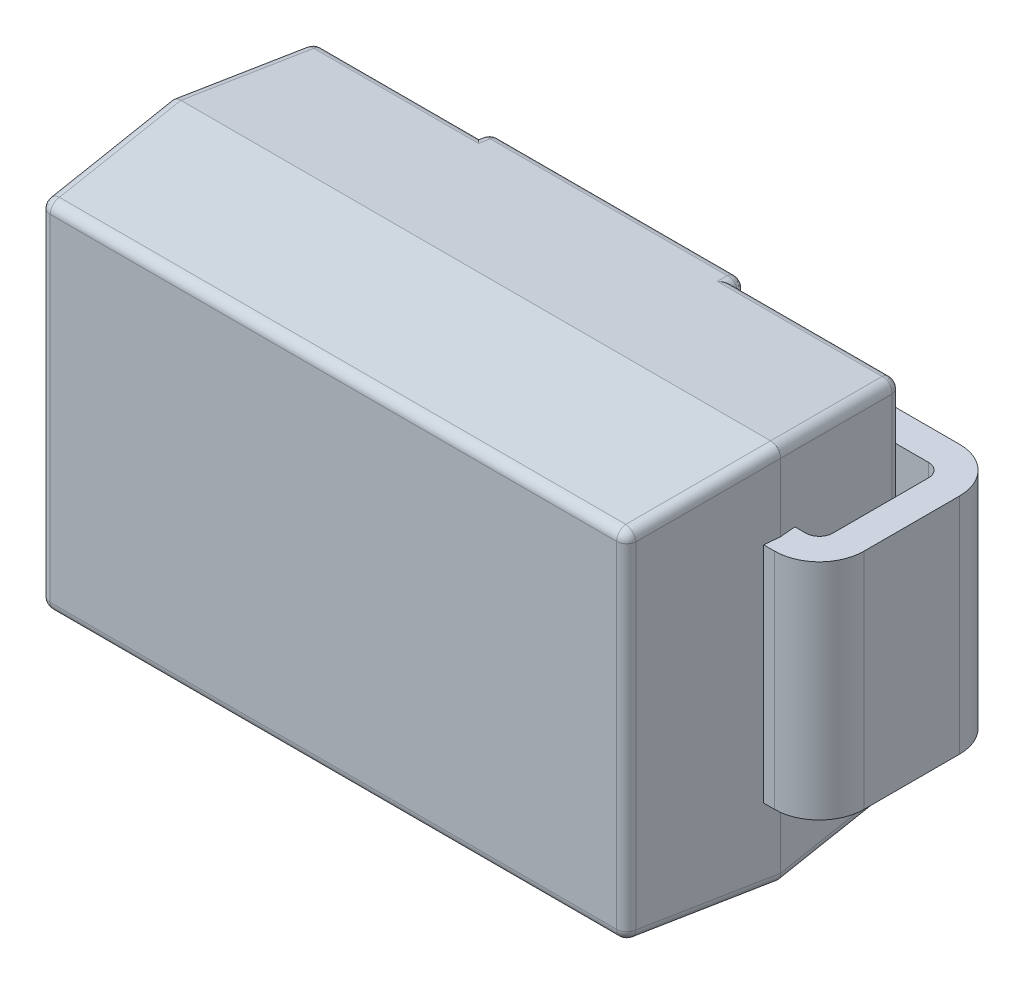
ISO-10303-21;
HEADER;
FILE_DESCRIPTION(('STEP AP214'),'2;1');
FILE_NAME('part.step','',(''),(''),'','','');
FILE_SCHEMA(('AUTOMOTIVE_DESIGN { 1 0 10303 214 1 1 1 1 }'));
ENDSEC;
DATA;
#1=APPLICATION_CONTEXT('core data for automotive mechanical design processes');
#2=APPLICATION_PROTOCOL_DEFINITION('international standard','automotive_design',2000,#1);
#3=PRODUCT_CONTEXT('',#1,'mechanical');
#4=PRODUCT('Part','Part','',(#3));
#5=PRODUCT_RELATED_PRODUCT_CATEGORY('part','',(#4));
#6=PRODUCT_DEFINITION_FORMATION('','',#4);
#7=PRODUCT_DEFINITION_CONTEXT('part definition',#1,'design');
#8=PRODUCT_DEFINITION('design','',#6,#7);
#9=PRODUCT_DEFINITION_SHAPE('','',#8);
#10=(LENGTH_UNIT() NAMED_UNIT(*) SI_UNIT(.MILLI.,.METRE.));
#11=(NAMED_UNIT(*) PLANE_ANGLE_UNIT() SI_UNIT($,.RADIAN.));
#12=(NAMED_UNIT(*) SI_UNIT($,.STERADIAN.) SOLID_ANGLE_UNIT());
#13=UNCERTAINTY_MEASURE_WITH_UNIT(LENGTH_MEASURE(1.E-05),#10,'distance_accuracy_value','');
#14=(GEOMETRIC_REPRESENTATION_CONTEXT(3) GLOBAL_UNCERTAINTY_ASSIGNED_CONTEXT((#13)) GLOBAL_UNIT_ASSIGNED_CONTEXT((#10,
#11,#12)) REPRESENTATION_CONTEXT('',''));
#15=CARTESIAN_POINT('',(0.,0.,0.));
#16=DIRECTION('',(0.,0.,1.));
#17=DIRECTION('',(1.,0.,0.));
#18=AXIS2_PLACEMENT_3D('',#15,#16,#17);
#19=CARTESIAN_POINT('',(0.,-0.825,1.135));
#20=DIRECTION('',(0.,0.,-1.));
#21=DIRECTION('',(-1.,0.,0.));
#22=AXIS2_PLACEMENT_3D('',#19,#20,#21);
#23=PLANE('',#22);
#24=DIRECTION('',(-1.,0.,0.));
#25=VECTOR('',#24,1.);
#26=CARTESIAN_POINT('',(0.,0.825,1.135));
#27=LINE('',#26,#25);
#28=CARTESIAN_POINT('',(-0.32,0.825,1.135));
#29=VERTEX_POINT('',#28);
#30=CARTESIAN_POINT('',(0.,0.825,1.135));
#31=VERTEX_POINT('',#30);
#32=EDGE_CURVE('P0_E101',#29,#31,#27,.F.);
#33=ORIENTED_EDGE('',*,*,#32,.T.);
#34=DIRECTION('',(0.,1.,0.));
#35=VECTOR('',#34,1.);
#36=CARTESIAN_POINT('',(0.,-0.825,1.135));
#37=LINE('',#36,#35);
#38=CARTESIAN_POINT('',(0.,-0.825,1.135));
#39=VERTEX_POINT('',#38);
#40=EDGE_CURVE('P0_E155',#39,#31,#37,.T.);
#41=ORIENTED_EDGE('',*,*,#40,.F.);
#42=DIRECTION('',(-1.,0.,0.));
#43=VECTOR('',#42,1.);
#44=CARTESIAN_POINT('',(0.,-0.825,1.135));
#45=LINE('',#44,#43);
#46=CARTESIAN_POINT('',(-0.32,-0.825,1.135));
#47=VERTEX_POINT('',#46);
#48=EDGE_CURVE('P0_E112',#39,#47,#45,.T.);
#49=ORIENTED_EDGE('',*,*,#48,.T.);
#50=DIRECTION('',(0.,-1.,0.));
#51=VECTOR('',#50,1.);
#52=CARTESIAN_POINT('',(-0.32,-0.825,1.135));
#53=LINE('',#52,#51);
#54=EDGE_CURVE('P0_E115',#47,#29,#53,.F.);
#55=ORIENTED_EDGE('',*,*,#54,.T.);
#56=EDGE_LOOP('',(#33,#41,#49,#55));
#57=FACE_BOUND('',#56,.T.);
#58=ADVANCED_FACE('P0_F16',(#57),#23,.T.);
#59=CARTESIAN_POINT('',(0.,-0.825,1.365));
#60=DIRECTION('',(1.,0.,0.));
#61=DIRECTION('',(0.,0.,-1.));
#62=AXIS2_PLACEMENT_3D('',#59,#60,#61);
#63=PLANE('',#62);
#64=DIRECTION('',(0.,0.,-1.));
#65=VECTOR('',#64,1.);
#66=CARTESIAN_POINT('',(0.,0.825,1.365));
#67=LINE('',#66,#65);
#68=CARTESIAN_POINT('',(0.,0.825,1.365));
#69=VERTEX_POINT('',#68);
#70=EDGE_CURVE('P0_E107',#31,#69,#67,.F.);
#71=ORIENTED_EDGE('',*,*,#70,.T.);
#72=DIRECTION('',(0.,1.,0.));
#73=VECTOR('',#72,1.);
#74=CARTESIAN_POINT('',(0.,-0.825,1.365));
#75=LINE('',#74,#73);
#76=CARTESIAN_POINT('',(0.,-0.825,1.365));
#77=VERTEX_POINT('',#76);
#78=EDGE_CURVE('P0_E128',#77,#69,#75,.T.);
#79=ORIENTED_EDGE('',*,*,#78,.F.);
#80=DIRECTION('',(0.,0.,-1.));
#81=VECTOR('',#80,1.);
#82=CARTESIAN_POINT('',(0.,-0.825,1.365));
#83=LINE('',#82,#81);
#84=EDGE_CURVE('P0_E111',#77,#39,#83,.T.);
#85=ORIENTED_EDGE('',*,*,#84,.T.);
#86=ORIENTED_EDGE('',*,*,#40,.T.);
#87=EDGE_LOOP('',(#71,#79,#85,#86));
#88=FACE_BOUND('',#87,.T.);
#89=ADVANCED_FACE('P0_F260',(#88),#63,.T.);
#90=CARTESIAN_POINT('',(-0.32,-0.825,1.035));
#91=DIRECTION('',(0.,-1.,0.));
#92=DIRECTION('',(0.,0.,-1.));
#93=AXIS2_PLACEMENT_3D('',#90,#91,#92);
#94=CYLINDRICAL_SURFACE('',#93,0.1);
#95=DIRECTION('',(0.,1.,0.));
#96=VECTOR('',#95,1.);
#97=CARTESIAN_POINT('',(-0.42,-0.825,1.035));
#98=LINE('',#97,#96);
#99=CARTESIAN_POINT('',(-0.42,0.825,1.035));
#100=VERTEX_POINT('',#99);
#101=CARTESIAN_POINT('',(-0.42,-0.825,1.035));
#102=VERTEX_POINT('',#101);
#103=EDGE_CURVE('P0_E122',#100,#102,#98,.F.);
#104=ORIENTED_EDGE('',*,*,#103,.F.);
#105=CARTESIAN_POINT('',(-0.32,0.825,1.035));
#106=DIRECTION('',(0.,-1.,0.));
#107=DIRECTION('',(0.,0.,-1.));
#108=AXIS2_PLACEMENT_3D('',#105,#106,#107);
#109=CIRCLE('',#108,0.1);
#110=EDGE_CURVE('P0_E19',#29,#100,#109,.T.);
#111=ORIENTED_EDGE('',*,*,#110,.F.);
#112=ORIENTED_EDGE('',*,*,#54,.F.);
#113=CARTESIAN_POINT('',(-0.32,-0.825,1.035));
#114=DIRECTION('',(0.,-1.,0.));
#115=DIRECTION('',(0.,0.,-1.));
#116=AXIS2_PLACEMENT_3D('',#113,#114,#115);
#117=CIRCLE('',#116,0.1);
#118=EDGE_CURVE('P0_E124',#102,#47,#117,.F.);
#119=ORIENTED_EDGE('',*,*,#118,.F.);
#120=EDGE_LOOP('',(#104,#111,#112,#119));
#121=FACE_BOUND('',#120,.T.);
#122=ADVANCED_FACE('P0_F120',(#121),#94,.F.);
#123=CARTESIAN_POINT('',(-0.32,-0.825,1.365));
#124=DIRECTION('',(0.,0.,1.));
#125=DIRECTION('',(1.,0.,0.));
#126=AXIS2_PLACEMENT_3D('',#123,#124,#125);
#127=PLANE('',#126);
#128=DIRECTION('',(1.,0.,0.));
#129=VECTOR('',#128,1.);
#130=CARTESIAN_POINT('',(-0.32,0.825,1.365));
#131=LINE('',#130,#129);
#132=CARTESIAN_POINT('',(-0.32,0.825,1.365));
#133=VERTEX_POINT('',#132);
#134=EDGE_CURVE('P0_E173',#69,#133,#131,.F.);
#135=ORIENTED_EDGE('',*,*,#134,.T.);
#136=DIRECTION('',(0.,1.,0.));
#137=VECTOR('',#136,1.);
#138=CARTESIAN_POINT('',(-0.32,-0.825,1.365));
#139=LINE('',#138,#137);
#140=CARTESIAN_POINT('',(-0.32,-0.825,1.365));
#141=VERTEX_POINT('',#140);
#142=EDGE_CURVE('P0_E134',#141,#133,#139,.T.);
#143=ORIENTED_EDGE('',*,*,#142,.F.);
#144=DIRECTION('',(1.,0.,0.));
#145=VECTOR('',#144,1.);
#146=CARTESIAN_POINT('',(-0.32,-0.825,1.365));
#147=LINE('',#146,#145);
#148=EDGE_CURVE('P0_E125',#141,#77,#147,.T.);
#149=ORIENTED_EDGE('',*,*,#148,.T.);
#150=ORIENTED_EDGE('',*,*,#78,.T.);
#151=EDGE_LOOP('',(#135,#143,#149,#150));
#152=FACE_BOUND('',#151,.T.);
#153=ADVANCED_FACE('P0_F258',(#152),#127,.T.);
#154=CARTESIAN_POINT('',(-0.42,-0.825,1.035));
#155=DIRECTION('',(1.,0.,0.));
#156=DIRECTION('',(0.,0.,-1.));
#157=AXIS2_PLACEMENT_3D('',#154,#155,#156);
#158=PLANE('',#157);
#159=DIRECTION('',(0.,0.,-1.));
#160=VECTOR('',#159,1.);
#161=CARTESIAN_POINT('',(-0.42,0.825,1.035));
#162=LINE('',#161,#160);
#163=CARTESIAN_POINT('',(-0.42,0.825,0.33));
#164=VERTEX_POINT('',#163);
#165=EDGE_CURVE('P0_E175',#164,#100,#162,.F.);
#166=ORIENTED_EDGE('',*,*,#165,.T.);
#167=ORIENTED_EDGE('',*,*,#103,.T.);
#168=DIRECTION('',(0.,0.,-1.));
#169=VECTOR('',#168,1.);
#170=CARTESIAN_POINT('',(-0.42,-0.825,1.035));
#171=LINE('',#170,#169);
#172=CARTESIAN_POINT('',(-0.42,-0.825,0.33));
#173=VERTEX_POINT('',#172);
#174=EDGE_CURVE('P0_E181',#102,#173,#171,.T.);
#175=ORIENTED_EDGE('',*,*,#174,.T.);
#176=DIRECTION('',(0.,-1.,0.));
#177=VECTOR('',#176,1.);
#178=CARTESIAN_POINT('',(-0.42,-0.825,0.33));
#179=LINE('',#178,#177);
#180=EDGE_CURVE('P0_E137',#173,#164,#179,.F.);
#181=ORIENTED_EDGE('',*,*,#180,.T.);
#182=EDGE_LOOP('',(#166,#167,#175,#181));
#183=FACE_BOUND('',#182,.T.);
#184=ADVANCED_FACE('P0_F266',(#183),#158,.T.);
#185=CARTESIAN_POINT('',(-0.32,-0.825,1.035));
#186=DIRECTION('',(0.,1.,0.));
#187=DIRECTION('',(0.,0.,1.));
#188=AXIS2_PLACEMENT_3D('',#185,#186,#187);
#189=CYLINDRICAL_SURFACE('',#188,0.33);
#190=CARTESIAN_POINT('',(-0.32,0.825,1.035));
#191=DIRECTION('',(0.,1.,0.));
#192=DIRECTION('',(0.,0.,1.));
#193=AXIS2_PLACEMENT_3D('',#190,#191,#192);
#194=CIRCLE('',#193,0.33);
#195=CARTESIAN_POINT('',(-0.65,0.825,1.035));
#196=VERTEX_POINT('',#195);
#197=EDGE_CURVE('P0_E135',#133,#196,#194,.F.);
#198=ORIENTED_EDGE('',*,*,#197,.T.);
#199=DIRECTION('',(0.,1.,0.));
#200=VECTOR('',#199,1.);
#201=CARTESIAN_POINT('',(-0.65,-0.825,1.035));
#202=LINE('',#201,#200);
#203=CARTESIAN_POINT('',(-0.65,-0.825,1.035));
#204=VERTEX_POINT('',#203);
#205=EDGE_CURVE('P0_E143',#204,#196,#202,.T.);
#206=ORIENTED_EDGE('',*,*,#205,.F.);
#207=CARTESIAN_POINT('',(-0.32,-0.825,1.035));
#208=DIRECTION('',(0.,1.,0.));
#209=DIRECTION('',(0.,0.,1.));
#210=AXIS2_PLACEMENT_3D('',#207,#208,#209);
#211=CIRCLE('',#210,0.33);
#212=EDGE_CURVE('P0_E131',#204,#141,#211,.T.);
#213=ORIENTED_EDGE('',*,*,#212,.T.);
#214=ORIENTED_EDGE('',*,*,#142,.T.);
#215=EDGE_LOOP('',(#198,#206,#213,#214));
#216=FACE_BOUND('',#215,.T.);
#217=ADVANCED_FACE('P0_F254',(#216),#189,.T.);
#218=CARTESIAN_POINT('',(-0.32,-0.825,0.33));
#219=DIRECTION('',(0.,-1.,0.));
#220=DIRECTION('',(0.,0.,-1.));
#221=AXIS2_PLACEMENT_3D('',#218,#219,#220);
#222=CYLINDRICAL_SURFACE('',#221,0.1);
#223=DIRECTION('',(0.,1.,0.));
#224=VECTOR('',#223,1.);
#225=CARTESIAN_POINT('',(-0.32,-0.825,0.23));
#226=LINE('',#225,#224);
#227=CARTESIAN_POINT('',(-0.32,0.825,0.23));
#228=VERTEX_POINT('',#227);
#229=CARTESIAN_POINT('',(-0.32,-0.825,0.23));
#230=VERTEX_POINT('',#229);
#231=EDGE_CURVE('P0_E192',#228,#230,#226,.F.);
#232=ORIENTED_EDGE('',*,*,#231,.F.);
#233=CARTESIAN_POINT('',(-0.32,0.825,0.33));
#234=DIRECTION('',(0.,-1.,0.));
#235=DIRECTION('',(0.,0.,-1.));
#236=AXIS2_PLACEMENT_3D('',#233,#234,#235);
#237=CIRCLE('',#236,0.1);
#238=EDGE_CURVE('P0_E138',#164,#228,#237,.T.);
#239=ORIENTED_EDGE('',*,*,#238,.F.);
#240=ORIENTED_EDGE('',*,*,#180,.F.);
#241=CARTESIAN_POINT('',(-0.32,-0.825,0.33));
#242=DIRECTION('',(0.,-1.,0.));
#243=DIRECTION('',(0.,0.,-1.));
#244=AXIS2_PLACEMENT_3D('',#241,#242,#243);
#245=CIRCLE('',#244,0.1);
#246=EDGE_CURVE('P0_E140',#230,#173,#245,.F.);
#247=ORIENTED_EDGE('',*,*,#246,.F.);
#248=EDGE_LOOP('',(#232,#239,#240,#247));
#249=FACE_BOUND('',#248,.T.);
#250=ADVANCED_FACE('P0_F264',(#249),#222,.F.);
#251=CARTESIAN_POINT('',(-0.65,-0.825,0.33));
#252=DIRECTION('',(-1.,0.,0.));
#253=DIRECTION('',(0.,0.,1.));
#254=AXIS2_PLACEMENT_3D('',#251,#252,#253);
#255=PLANE('',#254);
#256=DIRECTION('',(0.,0.,1.));
#257=VECTOR('',#256,1.);
#258=CARTESIAN_POINT('',(-0.65,0.825,0.33));
#259=LINE('',#258,#257);
#260=CARTESIAN_POINT('',(-0.65,0.825,0.33));
#261=VERTEX_POINT('',#260);
#262=EDGE_CURVE('P0_E190',#196,#261,#259,.F.);
#263=ORIENTED_EDGE('',*,*,#262,.T.);
#264=DIRECTION('',(0.,1.,0.));
#265=VECTOR('',#264,1.);
#266=CARTESIAN_POINT('',(-0.65,-0.825,0.33));
#267=LINE('',#266,#265);
#268=CARTESIAN_POINT('',(-0.65,-0.825,0.33));
#269=VERTEX_POINT('',#268);
#270=EDGE_CURVE('P0_E147',#269,#261,#267,.T.);
#271=ORIENTED_EDGE('',*,*,#270,.F.);
#272=DIRECTION('',(0.,0.,1.));
#273=VECTOR('',#272,1.);
#274=CARTESIAN_POINT('',(-0.65,-0.825,0.));
#275=LINE('',#274,#273);
#276=EDGE_CURVE('P0_E197',#269,#204,#275,.T.);
#277=ORIENTED_EDGE('',*,*,#276,.T.);
#278=ORIENTED_EDGE('',*,*,#205,.T.);
#279=EDGE_LOOP('',(#263,#271,#277,#278));
#280=FACE_BOUND('',#279,.T.);
#281=ADVANCED_FACE('P0_F251',(#280),#255,.T.);
#282=CARTESIAN_POINT('',(-0.32,-0.825,0.23));
#283=DIRECTION('',(0.,0.,1.));
#284=DIRECTION('',(1.,0.,0.));
#285=AXIS2_PLACEMENT_3D('',#282,#283,#284);
#286=PLANE('',#285);
#287=DIRECTION('',(1.,0.,0.));
#288=VECTOR('',#287,1.);
#289=CARTESIAN_POINT('',(0.,0.825,0.23));
#290=LINE('',#289,#288);
#291=CARTESIAN_POINT('',(0.85,0.825,0.23));
#292=VERTEX_POINT('',#291);
#293=EDGE_CURVE('P0_E152',#228,#292,#290,.T.);
#294=ORIENTED_EDGE('',*,*,#293,.F.);
#295=ORIENTED_EDGE('',*,*,#231,.T.);
#296=DIRECTION('',(1.,0.,0.));
#297=VECTOR('',#296,1.);
#298=CARTESIAN_POINT('',(0.,-0.825,0.23));
#299=LINE('',#298,#297);
#300=CARTESIAN_POINT('',(0.85,-0.825,0.23));
#301=VERTEX_POINT('',#300);
#302=EDGE_CURVE('P0_E148',#230,#301,#299,.T.);
#303=ORIENTED_EDGE('',*,*,#302,.T.);
#304=DIRECTION('',(0.,1.,0.));
#305=VECTOR('',#304,1.);
#306=CARTESIAN_POINT('',(0.85,-0.825,0.23));
#307=LINE('',#306,#305);
#308=EDGE_CURVE('P0_E200',#292,#301,#307,.F.);
#309=ORIENTED_EDGE('',*,*,#308,.F.);
#310=EDGE_LOOP('',(#294,#295,#303,#309));
#311=FACE_BOUND('',#310,.T.);
#312=ADVANCED_FACE('P0_F237',(#311),#286,.T.);
#313=CARTESIAN_POINT('',(0.,-0.825,0.));
#314=DIRECTION('',(0.,1.,0.));
#315=DIRECTION('',(0.,0.,1.));
#316=AXIS2_PLACEMENT_3D('',#313,#314,#315);
#317=PLANE('',#316);
#318=ORIENTED_EDGE('',*,*,#302,.F.);
#319=ORIENTED_EDGE('',*,*,#246,.T.);
#320=ORIENTED_EDGE('',*,*,#174,.F.);
#321=ORIENTED_EDGE('',*,*,#118,.T.);
#322=ORIENTED_EDGE('',*,*,#48,.F.);
#323=ORIENTED_EDGE('',*,*,#84,.F.);
#324=ORIENTED_EDGE('',*,*,#148,.F.);
#325=ORIENTED_EDGE('',*,*,#212,.F.);
#326=ORIENTED_EDGE('',*,*,#276,.F.);
#327=CARTESIAN_POINT('',(-0.32,-0.825,0.33));
#328=DIRECTION('',(0.,1.,0.));
#329=DIRECTION('',(0.,0.,1.));
#330=AXIS2_PLACEMENT_3D('',#327,#328,#329);
#331=CIRCLE('',#330,0.33);
#332=CARTESIAN_POINT('',(-0.32,-0.825,0.));
#333=VERTEX_POINT('',#332);
#334=EDGE_CURVE('P0_E144',#333,#269,#331,.T.);
#335=ORIENTED_EDGE('',*,*,#334,.F.);
#336=DIRECTION('',(-1.,0.,0.));
#337=VECTOR('',#336,1.);
#338=CARTESIAN_POINT('',(0.85,-0.825,0.));
#339=LINE('',#338,#337);
#340=CARTESIAN_POINT('',(0.85,-0.825,0.));
#341=VERTEX_POINT('',#340);
#342=EDGE_CURVE('P0_E203',#341,#333,#339,.T.);
#343=ORIENTED_EDGE('',*,*,#342,.F.);
#344=DIRECTION('',(0.,0.,-1.));
#345=VECTOR('',#344,1.);
#346=CARTESIAN_POINT('',(0.85,-0.825,0.23));
#347=LINE('',#346,#345);
#348=EDGE_CURVE('P0_E206',#301,#341,#347,.T.);
#349=ORIENTED_EDGE('',*,*,#348,.F.);
#350=EDGE_LOOP('',(#318,#319,#320,#321,#322,#323,#324,#325,#326,#335,#343,#349));
#351=FACE_BOUND('',#350,.T.);
#352=ADVANCED_FACE('P0_F261',(#351),#317,.F.);
#353=CARTESIAN_POINT('',(-0.32,-0.825,0.33));
#354=DIRECTION('',(0.,1.,0.));
#355=DIRECTION('',(0.,0.,1.));
#356=AXIS2_PLACEMENT_3D('',#353,#354,#355);
#357=CYLINDRICAL_SURFACE('',#356,0.33);
#358=CARTESIAN_POINT('',(-0.32,0.825,0.33));
#359=DIRECTION('',(0.,1.,0.));
#360=DIRECTION('',(0.,0.,1.));
#361=AXIS2_PLACEMENT_3D('',#358,#359,#360);
#362=CIRCLE('',#361,0.33);
#363=CARTESIAN_POINT('',(-0.32,0.825,0.));
#364=VERTEX_POINT('',#363);
#365=EDGE_CURVE('P0_E149',#364,#261,#362,.T.);
#366=ORIENTED_EDGE('',*,*,#365,.F.);
#367=DIRECTION('',(0.,1.,0.));
#368=VECTOR('',#367,1.);
#369=CARTESIAN_POINT('',(-0.32,-0.825,0.));
#370=LINE('',#369,#368);
#371=EDGE_CURVE('P0_E218',#333,#364,#370,.T.);
#372=ORIENTED_EDGE('',*,*,#371,.F.);
#373=ORIENTED_EDGE('',*,*,#334,.T.);
#374=ORIENTED_EDGE('',*,*,#270,.T.);
#375=EDGE_LOOP('',(#366,#372,#373,#374));
#376=FACE_BOUND('',#375,.T.);
#377=ADVANCED_FACE('P0_F248',(#376),#357,.T.);
#378=CARTESIAN_POINT('',(0.,0.825,0.));
#379=DIRECTION('',(0.,1.,0.));
#380=DIRECTION('',(0.,0.,1.));
#381=AXIS2_PLACEMENT_3D('',#378,#379,#380);
#382=PLANE('',#381);
#383=ORIENTED_EDGE('',*,*,#293,.T.);
#384=DIRECTION('',(0.,0.,-1.));
#385=VECTOR('',#384,1.);
#386=CARTESIAN_POINT('',(0.85,0.825,0.23));
#387=LINE('',#386,#385);
#388=CARTESIAN_POINT('',(0.85,0.825,0.));
#389=VERTEX_POINT('',#388);
#390=EDGE_CURVE('P0_E34',#389,#292,#387,.F.);
#391=ORIENTED_EDGE('',*,*,#390,.F.);
#392=DIRECTION('',(-1.,0.,0.));
#393=VECTOR('',#392,1.);
#394=CARTESIAN_POINT('',(0.85,0.825,0.));
#395=LINE('',#394,#393);
#396=EDGE_CURVE('P0_E25',#364,#389,#395,.F.);
#397=ORIENTED_EDGE('',*,*,#396,.F.);
#398=ORIENTED_EDGE('',*,*,#365,.T.);
#399=ORIENTED_EDGE('',*,*,#262,.F.);
#400=ORIENTED_EDGE('',*,*,#197,.F.);
#401=ORIENTED_EDGE('',*,*,#134,.F.);
#402=ORIENTED_EDGE('',*,*,#70,.F.);
#403=ORIENTED_EDGE('',*,*,#32,.F.);
#404=ORIENTED_EDGE('',*,*,#110,.T.);
#405=ORIENTED_EDGE('',*,*,#165,.F.);
#406=ORIENTED_EDGE('',*,*,#238,.T.);
#407=EDGE_LOOP('',(#383,#391,#397,#398,#399,#400,#401,#402,#403,#404,#405,#406));
#408=FACE_BOUND('',#407,.T.);
#409=ADVANCED_FACE('P0_F103',(#408),#382,.T.);
#410=CARTESIAN_POINT('',(0.85,-0.825,0.23));
#411=DIRECTION('',(1.,0.,0.));
#412=DIRECTION('',(0.,0.,-1.));
#413=AXIS2_PLACEMENT_3D('',#410,#411,#412);
#414=PLANE('',#413);
#415=ORIENTED_EDGE('',*,*,#390,.T.);
#416=ORIENTED_EDGE('',*,*,#308,.T.);
#417=ORIENTED_EDGE('',*,*,#348,.T.);
#418=DIRECTION('',(0.,1.,0.));
#419=VECTOR('',#418,1.);
#420=CARTESIAN_POINT('',(0.85,-0.825,0.));
#421=LINE('',#420,#419);
#422=EDGE_CURVE('P0_E11',#389,#341,#421,.F.);
#423=ORIENTED_EDGE('',*,*,#422,.F.);
#424=EDGE_LOOP('',(#415,#416,#417,#423));
#425=FACE_BOUND('',#424,.T.);
#426=ADVANCED_FACE('P0_F241',(#425),#414,.T.);
#427=CARTESIAN_POINT('',(0.85,-0.825,0.));
#428=DIRECTION('',(0.,0.,-1.));
#429=DIRECTION('',(-1.,0.,0.));
#430=AXIS2_PLACEMENT_3D('',#427,#428,#429);
#431=PLANE('',#430);
#432=ORIENTED_EDGE('',*,*,#396,.T.);
#433=ORIENTED_EDGE('',*,*,#422,.T.);
#434=ORIENTED_EDGE('',*,*,#342,.T.);
#435=ORIENTED_EDGE('',*,*,#371,.T.);
#436=EDGE_LOOP('',(#432,#433,#434,#435));
#437=FACE_BOUND('',#436,.T.);
#438=ADVANCED_FACE('P0_F243',(#437),#431,.T.);
#439=CLOSED_SHELL('',(#58,#89,#122,#153,#184,#217,#250,#281,#312,#352,#377,#409,#426,#438));
#440=MANIFOLD_SOLID_BREP('P0_B1',#439);
#441=CARTESIAN_POINT('',(2.95,1.31513599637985,0.28));
#442=DIRECTION('',(0.996194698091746,0.,-0.0871557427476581));
#443=DIRECTION('',(-0.0871557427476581,0.,-0.996194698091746));
#444=AXIS2_PLACEMENT_3D('',#441,#442,#443);
#445=PLANE('',#444);
#446=DIRECTION('',(0.,1.,0.));
#447=VECTOR('',#446,1.);
#448=CARTESIAN_POINT('',(2.95,0.,0.28));
#449=LINE('',#448,#447);
#450=CARTESIAN_POINT('',(2.95,1.24042139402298,0.28));
#451=VERTEX_POINT('',#450);
#452=CARTESIAN_POINT('',(2.95,-1.24042139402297,0.28));
#453=VERTEX_POINT('',#452);
#454=EDGE_CURVE('P1_E212',#451,#453,#449,.F.);
#455=ORIENTED_EDGE('',*,*,#454,.T.);
#456=DIRECTION('',(-0.0868265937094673,0.08682661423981,-0.992432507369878));
#457=VECTOR('',#456,1.);
#458=CARTESIAN_POINT('',(2.95,-1.24042139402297,0.28));
#459=LINE('',#458,#457);
#460=CARTESIAN_POINT('',(2.94899069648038,-1.23941206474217,0.26846331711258));
#461=VERTEX_POINT('',#460);
#462=EDGE_CURVE('P1_E220',#453,#461,#459,.T.);
#463=ORIENTED_EDGE('',*,*,#462,.T.);
#464=DIRECTION('',(0.,1.,0.));
#465=VECTOR('',#464,1.);
#466=CARTESIAN_POINT('',(2.9489906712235,-1.5334223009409,0.268463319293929));
#467=LINE('',#466,#465);
#468=CARTESIAN_POINT('',(2.9489906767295,1.23941217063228,0.268463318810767));
#469=VERTEX_POINT('',#468);
#470=EDGE_CURVE('P1_E218',#469,#461,#467,.F.);
#471=ORIENTED_EDGE('',*,*,#470,.F.);
#472=DIRECTION('',(0.0868265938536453,0.0868265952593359,0.99243250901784));
#473=VECTOR('',#472,1.);
#474=CARTESIAN_POINT('',(2.9489906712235,1.23941206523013,0.268463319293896));
#475=LINE('',#474,#473);
#476=EDGE_CURVE('P1_E206',#469,#451,#475,.T.);
#477=ORIENTED_EDGE('',*,*,#476,.T.);
#478=EDGE_LOOP('',(#455,#463,#471,#477));
#479=FACE_BOUND('',#478,.T.);
#480=ADVANCED_FACE('P1_F16',(#479),#445,.T.);
#481=CARTESIAN_POINT('',(0.,0.,0.28));
#482=DIRECTION('',(0.,0.,1.));
#483=DIRECTION('',(1.,0.,0.));
#484=AXIS2_PLACEMENT_3D('',#481,#482,#483);
#485=PLANE('',#484);
#486=ORIENTED_EDGE('',*,*,#454,.F.);
#487=CARTESIAN_POINT('',(2.87471351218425,1.2398495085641,0.28));
#488=DIRECTION('',(0.,0.,1.));
#489=DIRECTION('',(0.707106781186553,0.707106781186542,0.));
#490=AXIS2_PLACEMENT_3D('',#487,#488,#489);
#491=ELLIPSE('',#490,0.0755718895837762,0.075);
#492=CARTESIAN_POINT('',(2.94976119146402,1.24641115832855,0.28));
#493=VERTEX_POINT('',#492);
#494=EDGE_CURVE('P1_E202',#493,#451,#491,.F.);
#495=ORIENTED_EDGE('',*,*,#494,.F.);
#496=DIRECTION('',(1.,0.,0.));
#497=VECTOR('',#496,1.);
#498=CARTESIAN_POINT('',(0.,1.24641115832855,0.28));
#499=LINE('',#498,#497);
#500=CARTESIAN_POINT('',(4.09641115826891,1.24641115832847,0.279999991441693));
#501=VERTEX_POINT('',#500);
#502=EDGE_CURVE('P1_E197',#501,#493,#499,.F.);
#503=ORIENTED_EDGE('',*,*,#502,.F.);
#504=DIRECTION('',(0.,1.,0.));
#505=VECTOR('',#504,1.);
#506=CARTESIAN_POINT('',(4.09641115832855,-1.54042139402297,0.28));
#507=LINE('',#506,#505);
#508=CARTESIAN_POINT('',(4.09641115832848,-1.24641115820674,0.279999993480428));
#509=VERTEX_POINT('',#508);
#510=EDGE_CURVE('P1_E783',#509,#501,#507,.T.);
#511=ORIENTED_EDGE('',*,*,#510,.F.);
#512=DIRECTION('',(1.,0.,0.));
#513=VECTOR('',#512,1.);
#514=CARTESIAN_POINT('',(0.,-1.24641115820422,0.28));
#515=LINE('',#514,#513);
#516=CARTESIAN_POINT('',(2.94976119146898,-1.24641115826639,0.28));
#517=VERTEX_POINT('',#516);
#518=EDGE_CURVE('P1_E821',#517,#509,#515,.T.);
#519=ORIENTED_EDGE('',*,*,#518,.F.);
#520=CARTESIAN_POINT('',(2.87471351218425,-1.23984950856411,0.28));
#521=DIRECTION('',(0.,0.,1.));
#522=DIRECTION('',(0.707106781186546,-0.707106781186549,0.));
#523=AXIS2_PLACEMENT_3D('',#520,#521,#522);
#524=ELLIPSE('',#523,0.0755718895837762,0.075);
#525=EDGE_CURVE('P1_E224',#453,#517,#524,.F.);
#526=ORIENTED_EDGE('',*,*,#525,.F.);
#527=EDGE_LOOP('',(#486,#495,#503,#511,#519,#526));
#528=FACE_BOUND('',#527,.T.);
#529=ADVANCED_FACE('P1_F222',(#528),#485,.F.);
#530=CARTESIAN_POINT('',(1.05,-1.31513599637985,0.28));
#531=DIRECTION('',(-0.996194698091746,0.,-0.0871557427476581));
#532=DIRECTION('',(-0.0871557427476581,0.,0.996194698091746));
#533=AXIS2_PLACEMENT_3D('',#530,#531,#532);
#534=PLANE('',#533);
#535=DIRECTION('',(0.,1.,0.));
#536=VECTOR('',#535,1.);
#537=CARTESIAN_POINT('',(1.05,0.,0.28));
#538=LINE('',#537,#536);
#539=CARTESIAN_POINT('',(1.05,-1.24042139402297,0.28));
#540=VERTEX_POINT('',#539);
#541=CARTESIAN_POINT('',(1.05,1.24042139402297,0.28));
#542=VERTEX_POINT('',#541);
#543=EDGE_CURVE('P1_E298',#540,#542,#538,.T.);
#544=ORIENTED_EDGE('',*,*,#543,.T.);
#545=DIRECTION('',(0.0868265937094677,-0.0868266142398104,-0.992432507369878));
#546=VECTOR('',#545,1.);
#547=CARTESIAN_POINT('',(1.05,1.24042139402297,0.28));
#548=LINE('',#547,#546);
#549=CARTESIAN_POINT('',(1.05100928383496,1.2394120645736,0.268463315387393));
#550=VERTEX_POINT('',#549);
#551=EDGE_CURVE('P1_E804',#542,#550,#548,.T.);
#552=ORIENTED_EDGE('',*,*,#551,.T.);
#553=DIRECTION('',(0.,-1.,0.));
#554=VECTOR('',#553,1.);
#555=CARTESIAN_POINT('',(1.0510093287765,1.5334223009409,0.268463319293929));
#556=LINE('',#555,#554);
#557=CARTESIAN_POINT('',(1.05100932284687,-1.23941219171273,0.268463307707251));
#558=VERTEX_POINT('',#557);
#559=EDGE_CURVE('P1_E803',#558,#550,#556,.F.);
#560=ORIENTED_EDGE('',*,*,#559,.F.);
#561=DIRECTION('',(-0.0868265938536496,-0.0868265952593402,0.992432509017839));
#562=VECTOR('',#561,1.);
#563=CARTESIAN_POINT('',(1.0510093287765,-1.23941206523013,0.268463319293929));
#564=LINE('',#563,#562);
#565=EDGE_CURVE('P1_E226',#558,#540,#564,.T.);
#566=ORIENTED_EDGE('',*,*,#565,.T.);
#567=EDGE_LOOP('',(#544,#552,#560,#566));
#568=FACE_BOUND('',#567,.T.);
#569=ADVANCED_FACE('P1_F1331',(#568),#534,.T.);
#570=CARTESIAN_POINT('',(1.12572393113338,1.5334223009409,0.275));
#571=DIRECTION('',(0.,-1.,0.));
#572=DIRECTION('',(1.,0.,0.));
#573=AXIS2_PLACEMENT_3D('',#570,#571,#572);
#574=CYLINDRICAL_SURFACE('',#573,0.075);
#575=ORIENTED_EDGE('',*,*,#559,.T.);
#576=CARTESIAN_POINT('',(1.12572393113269,1.23941182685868,0.275000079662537));
#577=DIRECTION('',(-2.89475717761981E-06,-0.999999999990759,-3.17850055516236E-06));
#578=DIRECTION('',(9.1998070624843E-12,3.17850055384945E-06,-0.999999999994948));
#579=AXIS2_PLACEMENT_3D('',#576,#577,#578);
#580=CIRCLE('',#579,0.075000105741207);
#581=CARTESIAN_POINT('',(1.12572393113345,1.23941206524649,0.199999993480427));
#582=VERTEX_POINT('',#581);
#583=EDGE_CURVE('P1_E776',#550,#582,#580,.T.);
#584=ORIENTED_EDGE('',*,*,#583,.T.);
#585=DIRECTION('',(0.,1.,0.));
#586=VECTOR('',#585,1.);
#587=CARTESIAN_POINT('',(1.12572393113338,0.,0.2));
#588=LINE('',#587,#586);
#589=CARTESIAN_POINT('',(1.12572393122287,-1.23941206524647,0.2));
#590=VERTEX_POINT('',#589);
#591=EDGE_CURVE('P1_E1379',#582,#590,#588,.F.);
#592=ORIENTED_EDGE('',*,*,#591,.T.);
#593=CARTESIAN_POINT('',(1.12572393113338,-1.23941206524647,0.275));
#594=DIRECTION('',(0.,-1.,0.));
#595=DIRECTION('',(1.,0.,0.));
#596=AXIS2_PLACEMENT_3D('',#593,#594,#595);
#597=CIRCLE('',#596,0.075);
#598=EDGE_CURVE('P1_E800',#590,#558,#597,.F.);
#599=ORIENTED_EDGE('',*,*,#598,.T.);
#600=EDGE_LOOP('',(#575,#584,#592,#599));
#601=FACE_BOUND('',#600,.T.);
#602=ADVANCED_FACE('P1_F1324',(#601),#574,.T.);
#603=CARTESIAN_POINT('',(2.87427606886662,-1.5334223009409,0.275));
#604=DIRECTION('',(0.,1.,0.));
#605=DIRECTION('',(-1.,0.,0.));
#606=AXIS2_PLACEMENT_3D('',#603,#604,#605);
#607=CYLINDRICAL_SURFACE('',#606,0.075);
#608=ORIENTED_EDGE('',*,*,#470,.T.);
#609=CARTESIAN_POINT('',(2.87427606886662,-1.23941206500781,0.275));
#610=DIRECTION('',(0.,1.,0.));
#611=DIRECTION('',(-1.,0.,0.));
#612=AXIS2_PLACEMENT_3D('',#609,#610,#611);
#613=CIRCLE('',#612,0.075);
#614=CARTESIAN_POINT('',(2.87427606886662,-1.23941206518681,0.2));
#615=VERTEX_POINT('',#614);
#616=EDGE_CURVE('P1_E794',#461,#615,#613,.T.);
#617=ORIENTED_EDGE('',*,*,#616,.T.);
#618=DIRECTION('',(0.,1.,0.));
#619=VECTOR('',#618,1.);
#620=CARTESIAN_POINT('',(2.87427606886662,0.,0.2));
#621=LINE('',#620,#619);
#622=CARTESIAN_POINT('',(2.87427606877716,1.23941206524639,0.199999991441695));
#623=VERTEX_POINT('',#622);
#624=EDGE_CURVE('P1_E579',#615,#623,#621,.T.);
#625=ORIENTED_EDGE('',*,*,#624,.T.);
#626=CARTESIAN_POINT('',(2.87427606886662,1.23941275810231,0.274999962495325));
#627=DIRECTION('',(-6.33036562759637E-10,-0.999999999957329,9.23808249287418E-06));
#628=DIRECTION('',(0.,-9.23808249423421E-06,-0.999999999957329));
#629=AXIS2_PLACEMENT_3D('',#626,#627,#628);
#630=CIRCLE('',#629,0.0749999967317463);
#631=EDGE_CURVE('P1_E734',#623,#469,#630,.T.);
#632=ORIENTED_EDGE('',*,*,#631,.T.);
#633=EDGE_LOOP('',(#608,#617,#625,#632));
#634=FACE_BOUND('',#633,.T.);
#635=ADVANCED_FACE('P1_F834',(#634),#607,.T.);
#636=CARTESIAN_POINT('',(4.09641115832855,-1.54042139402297,0.355));
#637=DIRECTION('',(0.,1.,0.));
#638=DIRECTION('',(0.,0.,1.));
#639=AXIS2_PLACEMENT_3D('',#636,#637,#638);
#640=CYLINDRICAL_SURFACE('',#639,0.075);
#641=DIRECTION('',(0.,1.,0.));
#642=VECTOR('',#641,1.);
#643=CARTESIAN_POINT('',(4.17112576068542,-1.20315050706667,0.348463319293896));
#644=LINE('',#643,#642);
#645=CARTESIAN_POINT('',(4.17112580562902,-1.2464111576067,0.348463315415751));
#646=VERTEX_POINT('',#645);
#647=CARTESIAN_POINT('',(4.17112576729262,1.24641128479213,0.348463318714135));
#648=VERTEX_POINT('',#647);
#649=EDGE_CURVE('P1_E527',#646,#648,#644,.T.);
#650=ORIENTED_EDGE('',*,*,#649,.F.);
#651=CARTESIAN_POINT('',(4.09641115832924,-1.24641091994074,0.355000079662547));
#652=DIRECTION('',(2.89475730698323E-06,0.999999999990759,-3.17850069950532E-06));
#653=DIRECTION('',(-9.20558946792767E-12,-3.17850069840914E-06,-0.999999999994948));
#654=AXIS2_PLACEMENT_3D('',#651,#652,#653);
#655=CIRCLE('',#654,0.0750001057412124);
#656=EDGE_CURVE('P1_E571',#646,#509,#655,.T.);
#657=ORIENTED_EDGE('',*,*,#656,.T.);
#658=ORIENTED_EDGE('',*,*,#510,.T.);
#659=CARTESIAN_POINT('',(4.09641115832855,1.24641185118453,0.354999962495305));
#660=DIRECTION('',(-5.94006780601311E-10,-0.999999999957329,9.23808434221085E-06));
#661=DIRECTION('',(0.,-9.23808434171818E-06,-0.999999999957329));
#662=AXIS2_PLACEMENT_3D('',#659,#660,#661);
#663=CIRCLE('',#662,0.0749999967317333);
#664=EDGE_CURVE('P1_E300',#501,#648,#663,.T.);
#665=ORIENTED_EDGE('',*,*,#664,.T.);
#666=EDGE_LOOP('',(#650,#657,#658,#665));
#667=FACE_BOUND('',#666,.T.);
#668=ADVANCED_FACE('P1_F762',(#667),#640,.T.);
#669=CARTESIAN_POINT('',(1.12572393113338,1.23941206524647,0.2));
#670=CARTESIAN_POINT('',(1.05699791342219,1.23939852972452,0.2));
#671=CARTESIAN_POINT('',(1.05100921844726,1.23939735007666,0.268464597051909));
#672=CARTESIAN_POINT('',(1.12572393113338,1.23941206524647,0.2));
#673=CARTESIAN_POINT('',(1.0583874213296,1.25637757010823,0.2));
#674=CARTESIAN_POINT('',(1.05098734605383,1.25776871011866,0.266855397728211));
#675=CARTESIAN_POINT('',(1.12572393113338,1.23941206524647,0.2));
#676=CARTESIAN_POINT('',(1.06913997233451,1.27963730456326,0.2));
#677=CARTESIAN_POINT('',(1.0615621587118,1.28399001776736,0.265486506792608));
#678=CARTESIAN_POINT('',(1.12572393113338,1.23941206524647,0.2));
#679=CARTESIAN_POINT('',(1.0967940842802,1.30147137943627,0.2));
#680=CARTESIAN_POINT('',(1.09263316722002,1.30857537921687,0.266053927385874));
#681=CARTESIAN_POINT('',(1.12572393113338,1.23941206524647,0.2));
#682=CARTESIAN_POINT('',(1.1147766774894,1.30719870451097,0.2));
#683=CARTESIAN_POINT('',(1.1132309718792,1.31406232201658,0.267375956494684));
#684=CARTESIAN_POINT('',(1.12572393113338,1.23941206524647,0.2));
#685=CARTESIAN_POINT('',(1.12573746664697,1.30813808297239,0.2));
#686=CARTESIAN_POINT('',(1.1257386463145,1.31412677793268,0.26846459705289));
#687=(BOUNDED_SURFACE() B_SPLINE_SURFACE(3,2,((#669,#670,#671),(#672,#673,#674),(#675,#676,
#677),(#678,#679,#680),(#681,#682,#683),(#684,#685,#686)),.UNSPECIFIED.,.F.,.F.,
.F.) B_SPLINE_SURFACE_WITH_KNOTS((4,1,1,4),(3,3),(-0.000125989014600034,0.477098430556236,
0.692332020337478,1.00012598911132),(0.,1.),
.UNSPECIFIED.) GEOMETRIC_REPRESENTATION_ITEM() RATIONAL_B_SPLINE_SURFACE(((1.,0.737271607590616,
1.),(1.,0.744642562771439,1.),(1.,0.750773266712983,1.),(1.,0.747906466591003,1.),(1.,
0.741988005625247,1.),(1.,0.737271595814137,1.))) REPRESENTATION_ITEM('') SURFACE());
#688=CARTESIAN_POINT('',(1.05100921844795,1.23939735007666,0.268464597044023));
#689=CARTESIAN_POINT('',(1.05098734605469,1.2577687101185,0.266855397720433));
#690=CARTESIAN_POINT('',(1.06156215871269,1.28399001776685,0.265486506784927));
#691=CARTESIAN_POINT('',(1.09263316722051,1.30857537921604,0.266053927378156));
#692=CARTESIAN_POINT('',(1.11323097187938,1.31406232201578,0.267375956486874));
#693=CARTESIAN_POINT('',(1.1257386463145,1.31412677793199,0.268464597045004));
#694=(BOUNDED_CURVE() B_SPLINE_CURVE(3,(#688,#689,#690,#691,#692,#693),.UNSPECIFIED.,.F.,
.F.) B_SPLINE_CURVE_WITH_KNOTS((4,1,1,4),(-0.000125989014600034,0.477098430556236,
0.692332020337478,1.00012598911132),
.UNSPECIFIED.) CURVE() GEOMETRIC_REPRESENTATION_ITEM() RATIONAL_B_SPLINE_CURVE((0.999999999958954,
0.999999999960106,0.999999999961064,0.999999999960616,0.999999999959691,0.999999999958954)) REPRESENTATION_ITEM(''));
#695=CARTESIAN_POINT('',(1.12572393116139,1.31412667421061,0.268463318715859));
#696=VERTEX_POINT('',#695);
#697=EDGE_CURVE('P1_E295',#696,#550,#694,.F.);
#698=CARTESIAN_POINT('',(1.12572393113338,1.23941206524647,0.275));
#699=DIRECTION('',(-1.,0.,0.));
#700=DIRECTION('',(0.,-1.,0.));
#701=AXIS2_PLACEMENT_3D('',#698,#699,#700);
#702=CIRCLE('',#701,0.075);
#703=EDGE_CURVE('P1_E789',#582,#696,#702,.F.);
#704=ORIENTED_EDGE('',*,*,#583,.F.);
#705=ORIENTED_EDGE('',*,*,#697,.F.);
#706=ORIENTED_EDGE('',*,*,#703,.F.);
#707=EDGE_LOOP('',(#704,#705,#706));
#708=FACE_BOUND('',#707,.T.);
#709=ADVANCED_FACE('P1_F748',(#708),#687,.F.);
#710=CARTESIAN_POINT('',(2.87427606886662,1.23941206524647,0.2));
#711=CARTESIAN_POINT('',(2.87426253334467,1.30813808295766,0.2));
#712=CARTESIAN_POINT('',(2.8742613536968,1.3141267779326,0.268464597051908));
#713=CARTESIAN_POINT('',(2.87427606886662,1.23941206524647,0.2));
#714=CARTESIAN_POINT('',(2.89124157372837,1.30674857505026,0.2));
#715=CARTESIAN_POINT('',(2.89263271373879,1.31414865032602,0.266855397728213));
#716=CARTESIAN_POINT('',(2.87427606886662,1.23941206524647,0.2));
#717=CARTESIAN_POINT('',(2.91450130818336,1.29599602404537,0.2));
#718=CARTESIAN_POINT('',(2.91885402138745,1.30357383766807,0.26548650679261));
#719=CARTESIAN_POINT('',(2.87427606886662,1.23941206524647,0.2));
#720=CARTESIAN_POINT('',(2.9363353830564,1.26834191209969,0.2));
#721=CARTESIAN_POINT('',(2.943439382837,1.27250282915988,0.266053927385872));
#722=CARTESIAN_POINT('',(2.87427606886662,1.23941206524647,0.2));
#723=CARTESIAN_POINT('',(2.94206270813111,1.2503593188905,0.2));
#724=CARTESIAN_POINT('',(2.94892632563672,1.25190502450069,0.267375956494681));
#725=CARTESIAN_POINT('',(2.87427606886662,1.23941206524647,0.2));
#726=CARTESIAN_POINT('',(2.94300208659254,1.23939852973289,0.2));
#727=CARTESIAN_POINT('',(2.94899078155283,1.23939735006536,0.26846459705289));
#728=(BOUNDED_SURFACE() B_SPLINE_SURFACE(3,2,((#710,#711,#712),(#713,#714,#715),(#716,#717,
#718),(#719,#720,#721),(#722,#723,#724),(#725,#726,#727)),.UNSPECIFIED.,.F.,.F.,
.F.) B_SPLINE_SURFACE_WITH_KNOTS((4,1,1,4),(3,3),(-0.000125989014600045,0.477098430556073,
0.692332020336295,1.00012598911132),(0.,1.),
.UNSPECIFIED.) GEOMETRIC_REPRESENTATION_ITEM() RATIONAL_B_SPLINE_SURFACE(((1.,0.737271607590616,
1.),(1.,0.744642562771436,1.),(1.,0.750773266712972,1.),(1.,0.747906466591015,1.),(1.,
0.741988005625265,1.),(1.,0.737271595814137,1.))) REPRESENTATION_ITEM('') SURFACE());
#729=CARTESIAN_POINT('',(2.87427606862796,1.23941206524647,0.275));
#730=DIRECTION('',(-1.,0.,0.));
#731=DIRECTION('',(0.,-1.,0.));
#732=AXIS2_PLACEMENT_3D('',#729,#730,#731);
#733=CIRCLE('',#732,0.075);
#734=CARTESIAN_POINT('',(2.87427606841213,1.3141266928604,0.268463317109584));
#735=VERTEX_POINT('',#734);
#736=EDGE_CURVE('P1_E904',#735,#623,#733,.T.);
#737=CARTESIAN_POINT('',(2.8742613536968,1.31412677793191,0.268464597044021));
#738=CARTESIAN_POINT('',(2.89263271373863,1.31414865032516,0.266855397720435));
#739=CARTESIAN_POINT('',(2.91885402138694,1.30357383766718,0.265486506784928));
#740=CARTESIAN_POINT('',(2.94343938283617,1.27250282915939,0.266053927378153));
#741=CARTESIAN_POINT('',(2.94892632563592,1.25190502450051,0.26737595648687));
#742=CARTESIAN_POINT('',(2.94899078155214,1.23939735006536,0.268464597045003));
#743=(BOUNDED_CURVE() B_SPLINE_CURVE(3,(#737,#738,#739,#740,#741,#742),.UNSPECIFIED.,.F.,
.F.) B_SPLINE_CURVE_WITH_KNOTS((4,1,1,4),(-0.000125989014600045,0.477098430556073,
0.692332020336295,1.00012598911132),
.UNSPECIFIED.) CURVE() GEOMETRIC_REPRESENTATION_ITEM() RATIONAL_B_SPLINE_CURVE((0.99999999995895,
0.999999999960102,0.99999999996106,0.999999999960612,0.999999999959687,0.99999999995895)) REPRESENTATION_ITEM(''));
#744=EDGE_CURVE('P1_E288',#469,#735,#743,.F.);
#745=ORIENTED_EDGE('',*,*,#736,.F.);
#746=ORIENTED_EDGE('',*,*,#744,.F.);
#747=ORIENTED_EDGE('',*,*,#631,.F.);
#748=EDGE_LOOP('',(#745,#746,#747));
#749=FACE_BOUND('',#748,.T.);
#750=ADVANCED_FACE('P1_F736',(#749),#728,.F.);
#751=CARTESIAN_POINT('',(4.09641115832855,1.24641115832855,0.28));
#752=CARTESIAN_POINT('',(4.0963976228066,1.31513717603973,0.28));
#753=CARTESIAN_POINT('',(4.09639644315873,1.32112587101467,0.348464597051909));
#754=CARTESIAN_POINT('',(4.09641115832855,1.24641115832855,0.28));
#755=CARTESIAN_POINT('',(4.11337666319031,1.31374766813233,0.28));
#756=CARTESIAN_POINT('',(4.11476780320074,1.32114774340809,0.34685539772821));
#757=CARTESIAN_POINT('',(4.09641115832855,1.24641115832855,0.28));
#758=CARTESIAN_POINT('',(4.13663639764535,1.30299511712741,0.28));
#759=CARTESIAN_POINT('',(4.14098911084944,1.31057293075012,0.345486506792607));
#760=CARTESIAN_POINT('',(4.09641115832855,1.24641115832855,0.28));
#761=CARTESIAN_POINT('',(4.15847047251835,1.2753410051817,0.28));
#762=CARTESIAN_POINT('',(4.16557447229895,1.27950192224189,0.346053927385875));
#763=CARTESIAN_POINT('',(4.09641115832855,1.24641115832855,0.28));
#764=CARTESIAN_POINT('',(4.16419779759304,1.25735841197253,0.28));
#765=CARTESIAN_POINT('',(4.17106141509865,1.25890411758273,0.347375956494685));
#766=CARTESIAN_POINT('',(4.09641115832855,1.24641115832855,0.28));
#767=CARTESIAN_POINT('',(4.16513717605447,1.24639762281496,0.28));
#768=CARTESIAN_POINT('',(4.17112587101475,1.24639644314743,0.34846459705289));
#769=(BOUNDED_SURFACE() B_SPLINE_SURFACE(3,2,((#751,#752,#753),(#754,#755,#756),(#757,#758,
#759),(#760,#761,#762),(#763,#764,#765),(#766,#767,#768)),.UNSPECIFIED.,.F.,.F.,
.F.) B_SPLINE_SURFACE_WITH_KNOTS((4,1,1,4),(3,3),(-0.000125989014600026,0.477098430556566,
0.692332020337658,1.00012598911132),(0.,1.),
.UNSPECIFIED.) GEOMETRIC_REPRESENTATION_ITEM() RATIONAL_B_SPLINE_SURFACE(((1.,0.737271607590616,
1.),(1.,0.744642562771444,1.),(1.,0.750773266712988,1.),(1.,0.747906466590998,1.),(1.,
0.741988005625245,1.),(1.,0.737271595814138,1.))) REPRESENTATION_ITEM('') SURFACE());
#770=CARTESIAN_POINT('',(4.09641115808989,1.24641115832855,0.355));
#771=DIRECTION('',(-1.,0.,0.));
#772=DIRECTION('',(0.,-1.,0.));
#773=AXIS2_PLACEMENT_3D('',#770,#771,#772);
#774=CIRCLE('',#773,0.075);
#775=CARTESIAN_POINT('',(4.0964111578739,1.32112578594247,0.348463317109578));
#776=VERTEX_POINT('',#775);
#777=EDGE_CURVE('P1_E852',#776,#501,#774,.T.);
#778=CARTESIAN_POINT('',(4.09639644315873,1.32112587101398,0.348464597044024));
#779=CARTESIAN_POINT('',(4.11476780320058,1.32114774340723,0.346855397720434));
#780=CARTESIAN_POINT('',(4.14098911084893,1.31057293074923,0.345486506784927));
#781=CARTESIAN_POINT('',(4.16557447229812,1.2795019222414,0.346053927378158));
#782=CARTESIAN_POINT('',(4.17106141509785,1.25890411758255,0.347375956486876));
#783=CARTESIAN_POINT('',(4.17112587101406,1.24639644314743,0.348464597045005));
#784=(BOUNDED_CURVE() B_SPLINE_CURVE(3,(#778,#779,#780,#781,#782,#783),.UNSPECIFIED.,.F.,
.F.) B_SPLINE_CURVE_WITH_KNOTS((4,1,1,4),(-0.000125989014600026,0.477098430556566,
0.692332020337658,1.00012598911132),
.UNSPECIFIED.) CURVE() GEOMETRIC_REPRESENTATION_ITEM() RATIONAL_B_SPLINE_CURVE((0.999999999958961,
0.999999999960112,0.99999999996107,0.999999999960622,0.999999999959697,0.999999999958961)) REPRESENTATION_ITEM(''));
#785=EDGE_CURVE('P1_E287',#648,#776,#784,.F.);
#786=ORIENTED_EDGE('',*,*,#777,.F.);
#787=ORIENTED_EDGE('',*,*,#785,.F.);
#788=ORIENTED_EDGE('',*,*,#664,.F.);
#789=EDGE_LOOP('',(#786,#787,#788));
#790=FACE_BOUND('',#789,.T.);
#791=ADVANCED_FACE('P1_F747',(#790),#769,.F.);
#792=CARTESIAN_POINT('',(0.,0.,0.28));
#793=DIRECTION('',(0.,0.,1.));
#794=DIRECTION('',(1.,0.,0.));
#795=AXIS2_PLACEMENT_3D('',#792,#793,#794);
#796=PLANE('',#795);
#797=ORIENTED_EDGE('',*,*,#543,.F.);
#798=CARTESIAN_POINT('',(1.12528648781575,-1.23984950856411,0.28));
#799=DIRECTION('',(0.,0.,1.));
#800=DIRECTION('',(-0.707106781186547,-0.707106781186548,0.));
#801=AXIS2_PLACEMENT_3D('',#798,#799,#800);
#802=ELLIPSE('',#801,0.0755718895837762,0.075);
#803=CARTESIAN_POINT('',(1.05023880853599,-1.24641115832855,0.28));
#804=VERTEX_POINT('',#803);
#805=EDGE_CURVE('P1_E296',#804,#540,#802,.F.);
#806=ORIENTED_EDGE('',*,*,#805,.F.);
#807=DIRECTION('',(1.,0.,0.));
#808=VECTOR('',#807,1.);
#809=CARTESIAN_POINT('',(0.,-1.24641115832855,0.28));
#810=LINE('',#809,#808);
#811=CARTESIAN_POINT('',(-0.0964111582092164,-1.24641115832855,0.28));
#812=VERTEX_POINT('',#811);
#813=EDGE_CURVE('P1_E299',#812,#804,#810,.T.);
#814=ORIENTED_EDGE('',*,*,#813,.F.);
#815=DIRECTION('',(0.,-1.,0.));
#816=VECTOR('',#815,1.);
#817=CARTESIAN_POINT('',(-0.0964111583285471,1.54042139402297,0.28));
#818=LINE('',#817,#816);
#819=CARTESIAN_POINT('',(-0.0964111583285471,1.2464111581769,0.28));
#820=VERTEX_POINT('',#819);
#821=EDGE_CURVE('P1_E676',#820,#812,#818,.T.);
#822=ORIENTED_EDGE('',*,*,#821,.F.);
#823=DIRECTION('',(-1.,0.,0.));
#824=VECTOR('',#823,1.);
#825=CARTESIAN_POINT('',(1.65,1.24641115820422,0.28));
#826=LINE('',#825,#824);
#827=CARTESIAN_POINT('',(1.05023880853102,1.24641115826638,0.28));
#828=VERTEX_POINT('',#827);
#829=EDGE_CURVE('P1_E292',#828,#820,#826,.T.);
#830=ORIENTED_EDGE('',*,*,#829,.F.);
#831=CARTESIAN_POINT('',(1.12528648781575,1.2398495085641,0.28));
#832=DIRECTION('',(0.,0.,1.));
#833=DIRECTION('',(-0.707106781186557,0.707106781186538,0.));
#834=AXIS2_PLACEMENT_3D('',#831,#832,#833);
#835=ELLIPSE('',#834,0.0755718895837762,0.075);
#836=EDGE_CURVE('P1_E293',#542,#828,#835,.F.);
#837=ORIENTED_EDGE('',*,*,#836,.F.);
#838=EDGE_LOOP('',(#797,#806,#814,#822,#830,#837));
#839=FACE_BOUND('',#838,.T.);
#840=ADVANCED_FACE('P1_F662',(#839),#796,.F.);
#841=CARTESIAN_POINT('',(-0.096411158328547,1.24641115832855,0.28));
#842=CARTESIAN_POINT('',(-0.165137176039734,1.2463976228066,0.28));
#843=CARTESIAN_POINT('',(-0.17112587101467,1.24639644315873,0.348464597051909));
#844=CARTESIAN_POINT('',(-0.096411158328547,1.24641115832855,0.28));
#845=CARTESIAN_POINT('',(-0.16374766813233,1.26337666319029,0.28));
#846=CARTESIAN_POINT('',(-0.171147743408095,1.26476780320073,0.346855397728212));
#847=CARTESIAN_POINT('',(-0.096411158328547,1.24641115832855,0.28));
#848=CARTESIAN_POINT('',(-0.152995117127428,1.28663639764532,0.28));
#849=CARTESIAN_POINT('',(-0.160572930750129,1.29098911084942,0.345486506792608));
#850=CARTESIAN_POINT('',(-0.096411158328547,1.24641115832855,0.28));
#851=CARTESIAN_POINT('',(-0.125341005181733,1.30847047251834,0.28));
#852=CARTESIAN_POINT('',(-0.129501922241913,1.31557447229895,0.346053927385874));
#853=CARTESIAN_POINT('',(-0.096411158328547,1.24641115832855,0.28));
#854=CARTESIAN_POINT('',(-0.107358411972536,1.31419779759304,0.28));
#855=CARTESIAN_POINT('',(-0.108904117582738,1.32106141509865,0.347375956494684));
#856=CARTESIAN_POINT('',(-0.096411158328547,1.24641115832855,0.28));
#857=CARTESIAN_POINT('',(-0.0963976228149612,1.31513717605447,0.28));
#858=CARTESIAN_POINT('',(-0.096396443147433,1.32112587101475,0.34846459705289));
#859=(BOUNDED_SURFACE() B_SPLINE_SURFACE(3,2,((#841,#842,#843),(#844,#845,#846),(#847,#848,
#849),(#850,#851,#852),(#853,#854,#855),(#856,#857,#858)),.UNSPECIFIED.,.F.,.F.,
.F.) B_SPLINE_SURFACE_WITH_KNOTS((4,1,1,4),(3,3),(-0.000125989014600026,0.477098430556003,
0.692332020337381,1.00012598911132),(0.,1.),
.UNSPECIFIED.) GEOMETRIC_REPRESENTATION_ITEM() RATIONAL_B_SPLINE_SURFACE(((1.,0.737271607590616,
1.),(1.,0.744642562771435,1.),(1.,0.750773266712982,1.),(1.,0.747906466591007,1.),(1.,
0.74198800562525,1.),(1.,0.737271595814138,1.))) REPRESENTATION_ITEM('') SURFACE());
#860=CARTESIAN_POINT('',(-0.0964111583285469,1.24641115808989,0.355));
#861=DIRECTION('',(0.,-1.,0.));
#862=DIRECTION('',(1.,0.,0.));
#863=AXIS2_PLACEMENT_3D('',#860,#861,#862);
#864=CIRCLE('',#863,0.075);
#865=CARTESIAN_POINT('',(-0.171125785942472,1.24641115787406,0.348463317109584));
#866=VERTEX_POINT('',#865);
#867=EDGE_CURVE('P1_E1409',#866,#820,#864,.T.);
#868=CARTESIAN_POINT('',(-0.17112587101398,1.24639644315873,0.348464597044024));
#869=CARTESIAN_POINT('',(-0.171147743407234,1.26476780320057,0.346855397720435));
#870=CARTESIAN_POINT('',(-0.16057293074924,1.29098911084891,0.345486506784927));
#871=CARTESIAN_POINT('',(-0.129501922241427,1.31557447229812,0.346053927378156));
#872=CARTESIAN_POINT('',(-0.108904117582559,1.32106141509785,0.347375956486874));
#873=CARTESIAN_POINT('',(-0.0963964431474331,1.32112587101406,0.348464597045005));
#874=(BOUNDED_CURVE() B_SPLINE_CURVE(3,(#868,#869,#870,#871,#872,#873),.UNSPECIFIED.,.F.,
.F.) B_SPLINE_CURVE_WITH_KNOTS((4,1,1,4),(-0.000125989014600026,0.477098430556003,
0.692332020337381,1.00012598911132),
.UNSPECIFIED.) CURVE() GEOMETRIC_REPRESENTATION_ITEM() RATIONAL_B_SPLINE_CURVE((0.999999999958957,
0.999999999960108,0.999999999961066,0.999999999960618,0.999999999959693,0.999999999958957)) REPRESENTATION_ITEM(''));
#875=CARTESIAN_POINT('',(-0.0964111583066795,1.32112576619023,0.348463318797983));
#876=VERTEX_POINT('',#875);
#877=EDGE_CURVE('P1_E1385',#876,#866,#874,.F.);
#878=CARTESIAN_POINT('',(-0.0964111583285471,1.24641115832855,0.355));
#879=DIRECTION('',(-1.,0.,0.));
#880=DIRECTION('',(0.,0.,1.));
#881=AXIS2_PLACEMENT_3D('',#878,#879,#880);
#882=CIRCLE('',#881,0.075);
#883=EDGE_CURVE('P1_E885',#820,#876,#882,.F.);
#884=ORIENTED_EDGE('',*,*,#867,.F.);
#885=ORIENTED_EDGE('',*,*,#877,.F.);
#886=ORIENTED_EDGE('',*,*,#883,.F.);
#887=EDGE_LOOP('',(#884,#885,#886));
#888=FACE_BOUND('',#887,.T.);
#889=ADVANCED_FACE('P1_F655',(#888),#859,.F.);
#890=CARTESIAN_POINT('',(0.,0.,0.2));
#891=DIRECTION('',(0.,0.,1.));
#892=DIRECTION('',(1.,0.,0.));
#893=AXIS2_PLACEMENT_3D('',#890,#891,#892);
#894=PLANE('',#893);
#895=DIRECTION('',(1.,0.,0.));
#896=VECTOR('',#895,1.);
#897=CARTESIAN_POINT('',(0.831713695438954,-1.23941206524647,0.2));
#898=LINE('',#897,#896);
#899=EDGE_CURVE('P1_E634',#590,#615,#898,.T.);
#900=ORIENTED_EDGE('',*,*,#899,.F.);
#901=ORIENTED_EDGE('',*,*,#591,.F.);
#902=DIRECTION('',(-1.,0.,0.));
#903=VECTOR('',#902,1.);
#904=CARTESIAN_POINT('',(3.16828630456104,1.23941206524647,0.2));
#905=LINE('',#904,#903);
#906=EDGE_CURVE('P1_E786',#623,#582,#905,.T.);
#907=ORIENTED_EDGE('',*,*,#906,.F.);
#908=ORIENTED_EDGE('',*,*,#624,.F.);
#909=EDGE_LOOP('',(#900,#901,#907,#908));
#910=FACE_BOUND('',#909,.T.);
#911=ADVANCED_FACE('P1_F647',(#910),#894,.F.);
#912=CARTESIAN_POINT('',(2.87427606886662,-1.23941206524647,0.2));
#913=CARTESIAN_POINT('',(2.94300208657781,-1.23939852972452,0.2));
#914=CARTESIAN_POINT('',(2.94899078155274,-1.23939735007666,0.268464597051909));
#915=CARTESIAN_POINT('',(2.87427606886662,-1.23941206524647,0.2));
#916=CARTESIAN_POINT('',(2.94161257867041,-1.25637757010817,0.2));
#917=CARTESIAN_POINT('',(2.94901265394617,-1.25776871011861,0.266855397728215));
#918=CARTESIAN_POINT('',(2.87427606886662,-1.23941206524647,0.2));
#919=CARTESIAN_POINT('',(2.93086002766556,-1.27963730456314,0.2));
#920=CARTESIAN_POINT('',(2.93843784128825,-1.28399001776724,0.265486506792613));
#921=CARTESIAN_POINT('',(2.87427606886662,-1.23941206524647,0.2));
#922=CARTESIAN_POINT('',(2.90320591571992,-1.30147137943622,0.2));
#923=CARTESIAN_POINT('',(2.90736683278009,-1.30857537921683,0.266053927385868));
#924=CARTESIAN_POINT('',(2.87427606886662,-1.23941206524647,0.2));
#925=CARTESIAN_POINT('',(2.88522332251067,-1.30719870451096,0.2));
#926=CARTESIAN_POINT('',(2.88676902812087,-1.31406232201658,0.267375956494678));
#927=CARTESIAN_POINT('',(2.87427606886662,-1.23941206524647,0.2));
#928=CARTESIAN_POINT('',(2.87426253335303,-1.30813808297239,0.2));
#929=CARTESIAN_POINT('',(2.8742613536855,-1.31412677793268,0.26846459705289));
#930=(BOUNDED_SURFACE() B_SPLINE_SURFACE(3,2,((#912,#913,#914),(#915,#916,#917),(#918,#919,
#920),(#921,#922,#923),(#924,#925,#926),(#927,#928,#929)),.UNSPECIFIED.,.F.,.F.,
.F.) B_SPLINE_SURFACE_WITH_KNOTS((4,1,1,4),(3,3),(-0.000125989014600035,0.477098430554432,
0.692332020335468,1.00012598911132),(0.,1.),
.UNSPECIFIED.) GEOMETRIC_REPRESENTATION_ITEM() RATIONAL_B_SPLINE_SURFACE(((1.,0.737271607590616,
1.),(1.,0.744642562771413,1.),(1.,0.750773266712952,1.),(1.,0.747906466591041,1.),(1.,
0.741988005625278,1.),(1.,0.737271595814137,1.))) REPRESENTATION_ITEM('') SURFACE());
#931=CARTESIAN_POINT('',(2.87427606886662,-1.23941206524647,0.275));
#932=DIRECTION('',(1.,0.,0.));
#933=DIRECTION('',(0.,1.,0.));
#934=AXIS2_PLACEMENT_3D('',#931,#932,#933);
#935=CIRCLE('',#934,0.075);
#936=CARTESIAN_POINT('',(2.87427617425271,-1.31412667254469,0.2684633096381));
#937=VERTEX_POINT('',#936);
#938=EDGE_CURVE('P1_E827',#615,#937,#935,.F.);
#939=CARTESIAN_POINT('',(2.94899078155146,-1.23939735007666,0.268464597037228));
#940=CARTESIAN_POINT('',(2.94901265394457,-1.25776871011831,0.266855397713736));
#941=CARTESIAN_POINT('',(2.9384378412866,-1.28399001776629,0.265486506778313));
#942=CARTESIAN_POINT('',(2.90736683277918,-1.30857537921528,0.266053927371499));
#943=CARTESIAN_POINT('',(2.88676902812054,-1.3140623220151,0.267375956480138));
#944=CARTESIAN_POINT('',(2.8742613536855,-1.3141267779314,0.268464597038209));
#945=(BOUNDED_CURVE() B_SPLINE_CURVE(3,(#939,#940,#941,#942,#943,#944),.UNSPECIFIED.,.F.,
.F.) B_SPLINE_CURVE_WITH_KNOTS((4,1,1,4),(-0.000125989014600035,0.477098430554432,
0.692332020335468,1.00012598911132),
.UNSPECIFIED.) CURVE() GEOMETRIC_REPRESENTATION_ITEM() RATIONAL_B_SPLINE_CURVE((0.999999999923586,
0.99999999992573,0.999999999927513,0.999999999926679,0.999999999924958,0.999999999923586)) REPRESENTATION_ITEM(''));
#946=EDGE_CURVE('P1_E285',#937,#461,#945,.F.);
#947=ORIENTED_EDGE('',*,*,#938,.F.);
#948=ORIENTED_EDGE('',*,*,#616,.F.);
#949=ORIENTED_EDGE('',*,*,#946,.F.);
#950=EDGE_LOOP('',(#947,#948,#949));
#951=FACE_BOUND('',#950,.T.);
#952=ADVANCED_FACE('P1_F636',(#951),#930,.F.);
#953=CARTESIAN_POINT('',(1.12572393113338,-1.23941206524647,0.2));
#954=CARTESIAN_POINT('',(1.12573746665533,-1.30813808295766,0.2));
#955=CARTESIAN_POINT('',(1.1257386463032,-1.3141267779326,0.268464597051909));
#956=CARTESIAN_POINT('',(1.12572393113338,-1.23941206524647,0.2));
#957=CARTESIAN_POINT('',(1.10875842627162,-1.30674857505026,0.2));
#958=CARTESIAN_POINT('',(1.10736728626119,-1.31414865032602,0.266855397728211));
#959=CARTESIAN_POINT('',(1.12572393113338,-1.23941206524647,0.2));
#960=CARTESIAN_POINT('',(1.0854986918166,-1.29599602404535,0.2));
#961=CARTESIAN_POINT('',(1.0811459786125,-1.30357383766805,0.265486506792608));
#962=CARTESIAN_POINT('',(1.12572393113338,-1.23941206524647,0.2));
#963=CARTESIAN_POINT('',(1.06366461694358,-1.26834191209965,0.2));
#964=CARTESIAN_POINT('',(1.05656061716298,-1.27250282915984,0.266053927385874));
#965=CARTESIAN_POINT('',(1.12572393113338,-1.23941206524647,0.2));
#966=CARTESIAN_POINT('',(1.05793729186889,-1.25035931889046,0.2));
#967=CARTESIAN_POINT('',(1.05107367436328,-1.25190502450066,0.267375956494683));
#968=CARTESIAN_POINT('',(1.12572393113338,-1.23941206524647,0.2));
#969=CARTESIAN_POINT('',(1.05699791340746,-1.23939852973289,0.2));
#970=CARTESIAN_POINT('',(1.05100921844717,-1.23939735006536,0.26846459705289));
#971=(BOUNDED_SURFACE() B_SPLINE_SURFACE(3,2,((#953,#954,#955),(#956,#957,#958),(#959,#960,
#961),(#962,#963,#964),(#965,#966,#967),(#968,#969,#970)),.UNSPECIFIED.,.F.,.F.,
.F.) B_SPLINE_SURFACE_WITH_KNOTS((4,1,1,4),(3,3),(-0.000125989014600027,0.477098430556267,
0.692332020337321,1.00012598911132),(0.,1.),
.UNSPECIFIED.) GEOMETRIC_REPRESENTATION_ITEM() RATIONAL_B_SPLINE_SURFACE(((1.,0.737271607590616,
1.),(1.,0.744642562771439,1.),(1.,0.750773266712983,1.),(1.,0.747906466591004,1.),(1.,
0.74198800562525,1.),(1.,0.737271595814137,1.))) REPRESENTATION_ITEM('') SURFACE());
#972=CARTESIAN_POINT('',(1.1257386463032,-1.31412677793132,0.268464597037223));
#973=CARTESIAN_POINT('',(1.10736728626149,-1.31414865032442,0.266855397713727));
#974=CARTESIAN_POINT('',(1.08114597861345,-1.30357383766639,0.265486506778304));
#975=CARTESIAN_POINT('',(1.05656061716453,-1.27250282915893,0.266053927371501));
#976=CARTESIAN_POINT('',(1.05107367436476,-1.25190502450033,0.267375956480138));
#977=CARTESIAN_POINT('',(1.05100921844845,-1.23939735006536,0.268464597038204));
#978=(BOUNDED_CURVE() B_SPLINE_CURVE(3,(#972,#973,#974,#975,#976,#977),.UNSPECIFIED.,.F.,
.F.) B_SPLINE_CURVE_WITH_KNOTS((4,1,1,4),(-0.000125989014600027,0.477098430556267,
0.692332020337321,1.00012598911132),
.UNSPECIFIED.) CURVE() GEOMETRIC_REPRESENTATION_ITEM() RATIONAL_B_SPLINE_CURVE((0.999999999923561,
0.999999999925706,0.999999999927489,0.999999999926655,0.999999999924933,0.999999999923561)) REPRESENTATION_ITEM(''));
#979=CARTESIAN_POINT('',(1.12572393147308,-1.31412668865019,0.268463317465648));
#980=VERTEX_POINT('',#979);
#981=EDGE_CURVE('P1_E280',#558,#980,#978,.F.);
#982=CARTESIAN_POINT('',(1.12572393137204,-1.23941206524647,0.275));
#983=DIRECTION('',(1.,0.,0.));
#984=DIRECTION('',(0.,1.,0.));
#985=AXIS2_PLACEMENT_3D('',#982,#983,#984);
#986=CIRCLE('',#985,0.075);
#987=EDGE_CURVE('P1_E833',#980,#590,#986,.T.);
#988=ORIENTED_EDGE('',*,*,#981,.F.);
#989=ORIENTED_EDGE('',*,*,#598,.F.);
#990=ORIENTED_EDGE('',*,*,#987,.F.);
#991=EDGE_LOOP('',(#988,#989,#990));
#992=FACE_BOUND('',#991,.T.);
#993=ADVANCED_FACE('P1_F554',(#992),#971,.F.);
#994=CARTESIAN_POINT('',(4.09641115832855,-1.24641115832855,0.28));
#995=CARTESIAN_POINT('',(4.16513717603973,-1.2463976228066,0.28));
#996=CARTESIAN_POINT('',(4.17112587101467,-1.24639644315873,0.348464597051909));
#997=CARTESIAN_POINT('',(4.09641115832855,-1.24641115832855,0.28));
#998=CARTESIAN_POINT('',(4.16374766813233,-1.26337666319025,0.28));
#999=CARTESIAN_POINT('',(4.1711477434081,-1.2647678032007,0.346855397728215));
#1000=CARTESIAN_POINT('',(4.09641115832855,-1.24641115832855,0.28));
#1001=CARTESIAN_POINT('',(4.15299511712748,-1.28663639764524,0.28));
#1002=CARTESIAN_POINT('',(4.16057293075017,-1.29098911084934,0.345486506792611));
#1003=CARTESIAN_POINT('',(4.09641115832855,-1.24641115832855,0.28));
#1004=CARTESIAN_POINT('',(4.12534100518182,-1.30847047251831,0.28));
#1005=CARTESIAN_POINT('',(4.12950192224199,-1.31557447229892,0.346053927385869));
#1006=CARTESIAN_POINT('',(4.09641115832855,-1.24641115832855,0.28));
#1007=CARTESIAN_POINT('',(4.10735841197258,-1.31419779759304,0.28));
#1008=CARTESIAN_POINT('',(4.10890411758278,-1.32106141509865,0.34737595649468));
#1009=CARTESIAN_POINT('',(4.09641115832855,-1.24641115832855,0.28));
#1010=CARTESIAN_POINT('',(4.09639762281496,-1.31513717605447,0.28));
#1011=CARTESIAN_POINT('',(4.09639644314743,-1.32112587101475,0.34846459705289));
#1012=(BOUNDED_SURFACE() B_SPLINE_SURFACE(3,2,((#994,#995,#996),(#997,#998,#999),(#1000,#1001,
#1002),(#1003,#1004,#1005),(#1006,#1007,#1008),(#1009,#1010,#1011)),.UNSPECIFIED.,.F.,.F.,
.F.) B_SPLINE_SURFACE_WITH_KNOTS((4,1,1,4),(3,3),(-0.000125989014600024,0.47709843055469,
0.692332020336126,1.00012598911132),(0.,1.),
.UNSPECIFIED.) GEOMETRIC_REPRESENTATION_ITEM() RATIONAL_B_SPLINE_SURFACE(((1.,0.737271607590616,
1.),(1.,0.744642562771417,1.),(1.,0.75077326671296,1.),(1.,0.747906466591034,1.),(1.,
0.741988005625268,1.),(1.,0.737271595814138,1.))) REPRESENTATION_ITEM('') SURFACE());
#1013=CARTESIAN_POINT('',(4.09641115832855,-1.24641115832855,0.355));
#1014=DIRECTION('',(1.,0.,0.));
#1015=DIRECTION('',(0.,1.,0.));
#1016=AXIS2_PLACEMENT_3D('',#1013,#1014,#1015);
#1017=CIRCLE('',#1016,0.075);
#1018=CARTESIAN_POINT('',(4.09641128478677,-1.32112576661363,0.348463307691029));
#1019=VERTEX_POINT('',#1018);
#1020=EDGE_CURVE('P1_E284',#509,#1019,#1017,.F.);
#1021=CARTESIAN_POINT('',(4.17112587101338,-1.24639644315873,0.348464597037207));
#1022=CARTESIAN_POINT('',(4.17114774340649,-1.2647678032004,0.346855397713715));
#1023=CARTESIAN_POINT('',(4.16057293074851,-1.29098911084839,0.345486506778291));
#1024=CARTESIAN_POINT('',(4.12950192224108,-1.31557447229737,0.34605392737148));
#1025=CARTESIAN_POINT('',(4.10890411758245,-1.32106141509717,0.347375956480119));
#1026=CARTESIAN_POINT('',(4.09639644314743,-1.32112587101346,0.348464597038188));
#1027=(BOUNDED_CURVE() B_SPLINE_CURVE(3,(#1021,#1022,#1023,#1024,#1025,#1026),.UNSPECIFIED.,.F.,
.F.) B_SPLINE_CURVE_WITH_KNOTS((4,1,1,4),(-0.000125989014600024,0.47709843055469,
0.692332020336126,1.00012598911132),
.UNSPECIFIED.) CURVE() GEOMETRIC_REPRESENTATION_ITEM() RATIONAL_B_SPLINE_CURVE((0.999999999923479,
0.999999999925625,0.999999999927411,0.999999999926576,0.999999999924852,0.999999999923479)) REPRESENTATION_ITEM(''));
#1028=EDGE_CURVE('P1_E279',#1019,#646,#1027,.F.);
#1029=ORIENTED_EDGE('',*,*,#1020,.F.);
#1030=ORIENTED_EDGE('',*,*,#656,.F.);
#1031=ORIENTED_EDGE('',*,*,#1028,.F.);
#1032=EDGE_LOOP('',(#1029,#1030,#1031));
#1033=FACE_BOUND('',#1032,.T.);
#1034=ADVANCED_FACE('P1_F542',(#1033),#1012,.F.);
#1035=CARTESIAN_POINT('',(-0.096411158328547,-1.24641115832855,0.28));
#1036=CARTESIAN_POINT('',(-0.0963976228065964,-1.31513717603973,0.28));
#1037=CARTESIAN_POINT('',(-0.0963964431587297,-1.32112587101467,0.348464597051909));
#1038=CARTESIAN_POINT('',(-0.096411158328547,-1.24641115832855,0.28));
#1039=CARTESIAN_POINT('',(-0.1133766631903,-1.31374766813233,0.28));
#1040=CARTESIAN_POINT('',(-0.114767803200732,-1.3211477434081,0.346855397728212));
#1041=CARTESIAN_POINT('',(-0.096411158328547,-1.24641115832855,0.28));
#1042=CARTESIAN_POINT('',(-0.136636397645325,-1.30299511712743,0.28));
#1043=CARTESIAN_POINT('',(-0.140989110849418,-1.31057293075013,0.345486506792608));
#1044=CARTESIAN_POINT('',(-0.096411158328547,-1.24641115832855,0.28));
#1045=CARTESIAN_POINT('',(-0.158470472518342,-1.27534100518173,0.28));
#1046=CARTESIAN_POINT('',(-0.165574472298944,-1.27950192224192,0.346053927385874));
#1047=CARTESIAN_POINT('',(-0.096411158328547,-1.24641115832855,0.28));
#1048=CARTESIAN_POINT('',(-0.16419779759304,-1.25735841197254,0.28));
#1049=CARTESIAN_POINT('',(-0.171061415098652,-1.25890411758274,0.347375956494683));
#1050=CARTESIAN_POINT('',(-0.096411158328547,-1.24641115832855,0.28));
#1051=CARTESIAN_POINT('',(-0.165137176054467,-1.24639762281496,0.28));
#1052=CARTESIAN_POINT('',(-0.171125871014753,-1.24639644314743,0.34846459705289));
#1053=(BOUNDED_SURFACE() B_SPLINE_SURFACE(3,2,((#1035,#1036,#1037),(#1038,#1039,#1040),(#1041,
#1042,#1043),(#1044,#1045,#1046),(#1047,#1048,#1049),(#1050,#1051,#1052)),.UNSPECIFIED.,.F.,.F.,
.F.) B_SPLINE_SURFACE_WITH_KNOTS((4,1,1,4),(3,3),(-0.000125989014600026,0.477098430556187,
0.692332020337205,1.00012598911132),(0.,1.),
.UNSPECIFIED.) GEOMETRIC_REPRESENTATION_ITEM() RATIONAL_B_SPLINE_SURFACE(((1.,0.737271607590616,
1.),(1.,0.744642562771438,1.),(1.,0.750773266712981,1.),(1.,0.747906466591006,1.),(1.,
0.741988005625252,1.),(1.,0.737271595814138,1.))) REPRESENTATION_ITEM('') SURFACE());
#1054=CARTESIAN_POINT('',(-0.0963964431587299,-1.32112587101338,0.348464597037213));
#1055=CARTESIAN_POINT('',(-0.11476780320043,-1.3211477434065,0.346855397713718));
#1056=CARTESIAN_POINT('',(-0.140989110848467,-1.31057293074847,0.345486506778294));
#1057=CARTESIAN_POINT('',(-0.165574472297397,-1.27950192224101,0.346053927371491));
#1058=CARTESIAN_POINT('',(-0.171061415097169,-1.25890411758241,0.347375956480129));
#1059=CARTESIAN_POINT('',(-0.171125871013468,-1.24639644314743,0.348464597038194));
#1060=(BOUNDED_CURVE() B_SPLINE_CURVE(3,(#1054,#1055,#1056,#1057,#1058,#1059),.UNSPECIFIED.,.F.,
.F.) B_SPLINE_CURVE_WITH_KNOTS((4,1,1,4),(-0.000125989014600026,0.477098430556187,
0.692332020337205,1.00012598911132),
.UNSPECIFIED.) CURVE() GEOMETRIC_REPRESENTATION_ITEM() RATIONAL_B_SPLINE_CURVE((0.999999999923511,
0.999999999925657,0.999999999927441,0.999999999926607,0.999999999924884,0.999999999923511)) REPRESENTATION_ITEM(''));
#1061=CARTESIAN_POINT('',(-0.171125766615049,-1.24641128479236,0.348463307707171));
#1062=VERTEX_POINT('',#1061);
#1063=CARTESIAN_POINT('',(-0.0964111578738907,-1.32112578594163,0.348463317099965));
#1064=VERTEX_POINT('',#1063);
#1065=EDGE_CURVE('P1_E521',#1062,#1064,#1060,.F.);
#1066=CARTESIAN_POINT('',(-0.096411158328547,-1.24641115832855,0.355));
#1067=DIRECTION('',(0.,-1.,0.));
#1068=DIRECTION('',(1.,0.,0.));
#1069=AXIS2_PLACEMENT_3D('',#1066,#1067,#1068);
#1070=CIRCLE('',#1069,0.075);
#1071=EDGE_CURVE('P1_E684',#812,#1062,#1070,.F.);
#1072=CARTESIAN_POINT('',(-0.0964111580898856,-1.24641115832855,0.355));
#1073=DIRECTION('',(1.,0.,0.));
#1074=DIRECTION('',(0.,0.,-1.));
#1075=AXIS2_PLACEMENT_3D('',#1072,#1073,#1074);
#1076=CIRCLE('',#1075,0.075);
#1077=EDGE_CURVE('P1_E1415',#1064,#812,#1076,.T.);
#1078=ORIENTED_EDGE('',*,*,#1065,.F.);
#1079=ORIENTED_EDGE('',*,*,#1071,.F.);
#1080=ORIENTED_EDGE('',*,*,#1077,.F.);
#1081=EDGE_LOOP('',(#1078,#1079,#1080));
#1082=FACE_BOUND('',#1081,.T.);
#1083=ADVANCED_FACE('P1_F529',(#1082),#1053,.F.);
#1084=CARTESIAN_POINT('',(4.05315050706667,-1.20315050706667,-1.));
#1085=DIRECTION('',(0.996194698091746,0.,-0.0871557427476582));
#1086=DIRECTION('',(-0.0871557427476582,0.,-0.996194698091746));
#1087=AXIS2_PLACEMENT_3D('',#1084,#1085,#1086);
#1088=PLANE('',#1087);
#1089=DIRECTION('',(0.,1.,0.));
#1090=VECTOR('',#1089,1.);
#1091=CARTESIAN_POINT('',(4.25,-1.4,1.25));
#1092=LINE('',#1091,#1090);
#1093=CARTESIAN_POINT('',(4.25,-1.32528539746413,1.25000000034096));
#1094=VERTEX_POINT('',#1093);
#1095=CARTESIAN_POINT('',(4.25,1.32528539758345,1.249999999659));
#1096=VERTEX_POINT('',#1095);
#1097=EDGE_CURVE('P1_E881',#1094,#1096,#1092,.T.);
#1098=ORIENTED_EDGE('',*,*,#1097,.F.);
#1099=DIRECTION('',(-0.0868265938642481,0.0868265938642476,-0.992432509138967));
#1100=VECTOR('',#1099,1.);
#1101=CARTESIAN_POINT('',(4.1396512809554,-1.21493667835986,-0.0112916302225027));
#1102=LINE('',#1101,#1100);
#1103=EDGE_CURVE('P1_E857',#646,#1094,#1102,.F.);
#1104=ORIENTED_EDGE('',*,*,#1103,.F.);
#1105=ORIENTED_EDGE('',*,*,#649,.T.);
#1106=DIRECTION('',(-0.0868265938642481,-0.0868265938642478,-0.992432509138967));
#1107=VECTOR('',#1106,1.);
#1108=CARTESIAN_POINT('',(4.1396512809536,1.21493667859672,-0.011291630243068));
#1109=LINE('',#1108,#1107);
#1110=EDGE_CURVE('P1_E685',#1096,#648,#1109,.T.);
#1111=ORIENTED_EDGE('',*,*,#1110,.F.);
#1112=EDGE_LOOP('',(#1098,#1104,#1105,#1111));
#1113=FACE_BOUND('',#1112,.T.);
#1114=ADVANCED_FACE('P1_F541',(#1113),#1088,.T.);
#1115=CARTESIAN_POINT('',(3.16828630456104,1.23941206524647,0.275));
#1116=DIRECTION('',(-1.,0.,0.));
#1117=DIRECTION('',(0.,-1.,0.));
#1118=AXIS2_PLACEMENT_3D('',#1115,#1116,#1117);
#1119=CYLINDRICAL_SURFACE('',#1118,0.075);
#1120=DIRECTION('',(1.,0.,0.));
#1121=VECTOR('',#1120,1.);
#1122=CARTESIAN_POINT('',(4.05315050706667,1.31412666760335,0.268463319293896));
#1123=LINE('',#1122,#1121);
#1124=EDGE_CURVE('P1_E877',#735,#696,#1123,.F.);
#1125=ORIENTED_EDGE('',*,*,#1124,.F.);
#1126=ORIENTED_EDGE('',*,*,#736,.T.);
#1127=ORIENTED_EDGE('',*,*,#906,.T.);
#1128=ORIENTED_EDGE('',*,*,#703,.T.);
#1129=EDGE_LOOP('',(#1125,#1126,#1127,#1128));
#1130=FACE_BOUND('',#1129,.T.);
#1131=ADVANCED_FACE('P1_F914',(#1130),#1119,.T.);
#1132=CARTESIAN_POINT('',(1.06606561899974,1.29907037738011,0.956897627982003));
#1133=DIRECTION('',(-0.0868265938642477,0.0868265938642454,0.992432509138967));
#1134=DIRECTION('',(0.996194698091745,0.,0.0871557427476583));
#1135=AXIS2_PLACEMENT_3D('',#1132,#1133,#1134);
#1136=CYLINDRICAL_SURFACE('',#1135,0.075);
#1137=CARTESIAN_POINT('',(1.11872483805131,1.24641115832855,0.355));
#1138=DIRECTION('',(-0.73716571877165,0.058892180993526,0.673140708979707));
#1139=DIRECTION('',(0.675711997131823,0.0642482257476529,0.734360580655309));
#1140=AXIS2_PLACEMENT_3D('',#1137,#1138,#1139);
#1141=ELLIPSE('',#1140,0.101741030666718,0.075);
#1142=CARTESIAN_POINT('',(1.11872483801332,1.32112576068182,0.348463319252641));
#1143=VERTEX_POINT('',#1142);
#1144=EDGE_CURVE('P1_E289',#1143,#828,#1141,.T.);
#1145=ORIENTED_EDGE('',*,*,#1144,.F.);
#1146=DIRECTION('',(-0.0868265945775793,0.0868265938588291,0.992432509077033));
#1147=VECTOR('',#1146,1.);
#1148=CARTESIAN_POINT('',(1.12572393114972,1.31412666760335,0.268463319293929));
#1149=LINE('',#1148,#1147);
#1150=EDGE_CURVE('P1_E880',#696,#1143,#1149,.T.);
#1151=ORIENTED_EDGE('',*,*,#1150,.F.);
#1152=ORIENTED_EDGE('',*,*,#697,.T.);
#1153=ORIENTED_EDGE('',*,*,#551,.F.);
#1154=ORIENTED_EDGE('',*,*,#836,.T.);
#1155=EDGE_LOOP('',(#1145,#1151,#1152,#1153,#1154));
#1156=FACE_BOUND('',#1155,.T.);
#1157=ADVANCED_FACE('P1_F918',(#1156),#1136,.T.);
#1158=CARTESIAN_POINT('',(1.65,1.24641115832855,0.355));
#1159=DIRECTION('',(-1.,0.,0.));
#1160=DIRECTION('',(0.,0.,1.));
#1161=AXIS2_PLACEMENT_3D('',#1158,#1159,#1160);
#1162=CYLINDRICAL_SURFACE('',#1161,0.075);
#1163=ORIENTED_EDGE('',*,*,#883,.T.);
#1164=DIRECTION('',(1.,0.,0.));
#1165=VECTOR('',#1164,1.);
#1166=CARTESIAN_POINT('',(4.05315050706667,1.32112576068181,0.348463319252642));
#1167=LINE('',#1166,#1165);
#1168=EDGE_CURVE('P1_E273',#1143,#876,#1167,.F.);
#1169=ORIENTED_EDGE('',*,*,#1168,.F.);
#1170=ORIENTED_EDGE('',*,*,#1144,.T.);
#1171=ORIENTED_EDGE('',*,*,#829,.T.);
#1172=EDGE_LOOP('',(#1163,#1169,#1170,#1171));
#1173=FACE_BOUND('',#1172,.T.);
#1174=ADVANCED_FACE('P1_F924',(#1173),#1162,.T.);
#1175=CARTESIAN_POINT('',(4.39042139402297,1.24641115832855,0.355));
#1176=DIRECTION('',(-1.,0.,0.));
#1177=DIRECTION('',(0.,-1.,0.));
#1178=AXIS2_PLACEMENT_3D('',#1175,#1176,#1177);
#1179=CYLINDRICAL_SURFACE('',#1178,0.075);
#1180=DIRECTION('',(1.,0.,0.));
#1181=VECTOR('',#1180,1.);
#1182=CARTESIAN_POINT('',(4.05315050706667,1.32112576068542,0.348463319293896));
#1183=LINE('',#1182,#1181);
#1184=CARTESIAN_POINT('',(2.88127516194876,1.32112576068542,0.348463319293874));
#1185=VERTEX_POINT('',#1184);
#1186=EDGE_CURVE('P1_E867',#776,#1185,#1183,.F.);
#1187=ORIENTED_EDGE('',*,*,#1186,.F.);
#1188=ORIENTED_EDGE('',*,*,#777,.T.);
#1189=ORIENTED_EDGE('',*,*,#502,.T.);
#1190=CARTESIAN_POINT('',(2.8812751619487,1.24641115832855,0.355));
#1191=DIRECTION('',(0.73716571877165,0.0588921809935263,0.673140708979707));
#1192=DIRECTION('',(-0.675711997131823,0.0642482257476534,0.734360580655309));
#1193=AXIS2_PLACEMENT_3D('',#1190,#1191,#1192);
#1194=ELLIPSE('',#1193,0.101741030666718,0.075);
#1195=EDGE_CURVE('P1_E209',#1185,#493,#1194,.F.);
#1196=ORIENTED_EDGE('',*,*,#1195,.F.);
#1197=EDGE_LOOP('',(#1187,#1188,#1189,#1196));
#1198=FACE_BOUND('',#1197,.T.);
#1199=ADVANCED_FACE('P1_F713',(#1198),#1179,.T.);
#1200=CARTESIAN_POINT('',(2.92794461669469,1.29308061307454,0.888434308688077));
#1201=DIRECTION('',(0.0868265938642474,0.086826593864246,0.992432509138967));
#1202=DIRECTION('',(0.996194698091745,0.,-0.087155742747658));
#1203=AXIS2_PLACEMENT_3D('',#1200,#1201,#1202);
#1204=CYLINDRICAL_SURFACE('',#1203,0.075);
#1205=ORIENTED_EDGE('',*,*,#494,.T.);
#1206=ORIENTED_EDGE('',*,*,#476,.F.);
#1207=ORIENTED_EDGE('',*,*,#744,.T.);
#1208=DIRECTION('',(-0.0868265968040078,-0.0868265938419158,-0.992432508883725));
#1209=VECTOR('',#1208,1.);
#1210=CARTESIAN_POINT('',(2.8812751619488,1.32112576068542,0.348463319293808));
#1211=LINE('',#1210,#1209);
#1212=EDGE_CURVE('P1_E870',#1185,#735,#1211,.T.);
#1213=ORIENTED_EDGE('',*,*,#1212,.F.);
#1214=ORIENTED_EDGE('',*,*,#1195,.T.);
#1215=EDGE_LOOP('',(#1205,#1206,#1207,#1213,#1214));
#1216=FACE_BOUND('',#1215,.T.);
#1217=ADVANCED_FACE('P1_F204',(#1216),#1204,.T.);
#1218=CARTESIAN_POINT('',(4.06493667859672,1.21493667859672,-0.00475494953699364));
#1219=DIRECTION('',(-0.0868265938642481,-0.0868265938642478,-0.992432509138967));
#1220=DIRECTION('',(-0.996194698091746,0.,0.0871557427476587));
#1221=AXIS2_PLACEMENT_3D('',#1218,#1219,#1220);
#1222=CYLINDRICAL_SURFACE('',#1221,0.075);
#1223=CARTESIAN_POINT('',(4.17471351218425,1.32471351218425,1.24999999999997));
#1224=DIRECTION('',(0.,0.,-1.));
#1225=DIRECTION('',(0.707106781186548,0.707106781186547,0.));
#1226=AXIS2_PLACEMENT_3D('',#1223,#1224,#1225);
#1227=ELLIPSE('',#1226,0.0755718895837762,0.075);
#1228=CARTESIAN_POINT('',(4.17528539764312,1.4,1.24999999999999));
#1229=VERTEX_POINT('',#1228);
#1230=EDGE_CURVE('P1_E264',#1096,#1229,#1227,.F.);
#1231=ORIENTED_EDGE('',*,*,#1230,.F.);
#1232=ORIENTED_EDGE('',*,*,#1110,.T.);
#1233=ORIENTED_EDGE('',*,*,#785,.T.);
#1234=DIRECTION('',(-0.0868265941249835,-0.086826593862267,-0.992432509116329));
#1235=VECTOR('',#1234,1.);
#1236=CARTESIAN_POINT('',(4.17528539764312,1.4,1.25));
#1237=LINE('',#1236,#1235);
#1238=EDGE_CURVE('P1_E272',#1229,#776,#1237,.T.);
#1239=ORIENTED_EDGE('',*,*,#1238,.F.);
#1240=EDGE_LOOP('',(#1231,#1232,#1233,#1239));
#1241=FACE_BOUND('',#1240,.T.);
#1242=ADVANCED_FACE('P1_F699',(#1241),#1222,.T.);
#1243=CARTESIAN_POINT('',(-0.0964111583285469,1.54042139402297,0.355));
#1244=DIRECTION('',(0.,-1.,0.));
#1245=DIRECTION('',(1.,0.,0.));
#1246=AXIS2_PLACEMENT_3D('',#1243,#1244,#1245);
#1247=CYLINDRICAL_SURFACE('',#1246,0.075);
#1248=DIRECTION('',(0.,1.,0.));
#1249=VECTOR('',#1248,1.);
#1250=CARTESIAN_POINT('',(-0.171125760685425,1.20315050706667,0.348463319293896));
#1251=LINE('',#1250,#1249);
#1252=EDGE_CURVE('P1_E267',#866,#1062,#1251,.F.);
#1253=ORIENTED_EDGE('',*,*,#1252,.F.);
#1254=ORIENTED_EDGE('',*,*,#867,.T.);
#1255=ORIENTED_EDGE('',*,*,#821,.T.);
#1256=ORIENTED_EDGE('',*,*,#1071,.T.);
#1257=EDGE_LOOP('',(#1253,#1254,#1255,#1256));
#1258=FACE_BOUND('',#1257,.T.);
#1259=ADVANCED_FACE('P1_F709',(#1258),#1247,.T.);
#1260=CARTESIAN_POINT('',(-0.0649366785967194,1.21493667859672,-0.00475494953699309));
#1261=DIRECTION('',(0.0868265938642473,-0.0868265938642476,-0.992432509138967));
#1262=DIRECTION('',(0.,0.996194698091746,-0.0871557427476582));
#1263=AXIS2_PLACEMENT_3D('',#1260,#1261,#1262);
#1264=CYLINDRICAL_SURFACE('',#1263,0.075);
#1265=CARTESIAN_POINT('',(-0.174713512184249,1.32471351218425,1.24999999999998));
#1266=DIRECTION('',(0.,0.,-1.));
#1267=DIRECTION('',(-0.707106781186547,0.707106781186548,0.));
#1268=AXIS2_PLACEMENT_3D('',#1265,#1266,#1267);
#1269=ELLIPSE('',#1268,0.0755718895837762,0.075);
#1270=CARTESIAN_POINT('',(-0.175285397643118,1.4,1.24999999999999));
#1271=VERTEX_POINT('',#1270);
#1272=CARTESIAN_POINT('',(-0.25,1.32528539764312,1.24999999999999));
#1273=VERTEX_POINT('',#1272);
#1274=EDGE_CURVE('P1_E260',#1271,#1273,#1269,.F.);
#1275=ORIENTED_EDGE('',*,*,#1274,.F.);
#1276=DIRECTION('',(-0.0868265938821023,0.0868265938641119,0.992432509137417));
#1277=VECTOR('',#1276,1.);
#1278=CARTESIAN_POINT('',(-0.0964111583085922,1.32112576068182,0.348463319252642));
#1279=LINE('',#1278,#1277);
#1280=EDGE_CURVE('P1_E269',#876,#1271,#1279,.T.);
#1281=ORIENTED_EDGE('',*,*,#1280,.F.);
#1282=ORIENTED_EDGE('',*,*,#877,.T.);
#1283=DIRECTION('',(0.086826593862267,-0.0868265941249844,-0.992432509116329));
#1284=VECTOR('',#1283,1.);
#1285=CARTESIAN_POINT('',(-0.25,1.32528539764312,1.25));
#1286=LINE('',#1285,#1284);
#1287=EDGE_CURVE('P1_E263',#1273,#866,#1286,.T.);
#1288=ORIENTED_EDGE('',*,*,#1287,.F.);
#1289=EDGE_LOOP('',(#1275,#1281,#1282,#1288));
#1290=FACE_BOUND('',#1289,.T.);
#1291=ADVANCED_FACE('P1_F1203',(#1290),#1264,.T.);
#1292=CARTESIAN_POINT('',(0.831713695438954,-1.23941206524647,0.275));
#1293=DIRECTION('',(1.,0.,0.));
#1294=DIRECTION('',(0.,1.,0.));
#1295=AXIS2_PLACEMENT_3D('',#1292,#1293,#1294);
#1296=CYLINDRICAL_SURFACE('',#1295,0.075);
#1297=DIRECTION('',(1.,0.,0.));
#1298=VECTOR('',#1297,1.);
#1299=CARTESIAN_POINT('',(-0.0531505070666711,-1.31412666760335,0.268463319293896));
#1300=LINE('',#1299,#1298);
#1301=EDGE_CURVE('P1_E257',#980,#937,#1300,.T.);
#1302=ORIENTED_EDGE('',*,*,#1301,.F.);
#1303=ORIENTED_EDGE('',*,*,#987,.T.);
#1304=ORIENTED_EDGE('',*,*,#899,.T.);
#1305=ORIENTED_EDGE('',*,*,#938,.T.);
#1306=EDGE_LOOP('',(#1302,#1303,#1304,#1305));
#1307=FACE_BOUND('',#1306,.T.);
#1308=ADVANCED_FACE('P1_F612',(#1307),#1296,.T.);
#1309=CARTESIAN_POINT('',(2.93393438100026,-1.29907037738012,0.956897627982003));
#1310=DIRECTION('',(0.0868265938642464,-0.0868265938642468,0.992432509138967));
#1311=DIRECTION('',(0.,-0.996194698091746,-0.0871557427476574));
#1312=AXIS2_PLACEMENT_3D('',#1309,#1310,#1311);
#1313=CYLINDRICAL_SURFACE('',#1312,0.075);
#1314=CARTESIAN_POINT('',(2.88127516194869,-1.24641115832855,0.355));
#1315=DIRECTION('',(0.73716571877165,-0.0588921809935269,0.673140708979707));
#1316=DIRECTION('',(-0.675711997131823,-0.064248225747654,0.734360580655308));
#1317=AXIS2_PLACEMENT_3D('',#1314,#1315,#1316);
#1318=ELLIPSE('',#1317,0.101741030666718,0.075);
#1319=CARTESIAN_POINT('',(2.88127516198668,-1.32112576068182,0.348463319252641));
#1320=VERTEX_POINT('',#1319);
#1321=EDGE_CURVE('P1_E281',#1320,#517,#1318,.T.);
#1322=ORIENTED_EDGE('',*,*,#1321,.F.);
#1323=DIRECTION('',(0.0868265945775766,-0.0868265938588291,0.992432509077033));
#1324=VECTOR('',#1323,1.);
#1325=CARTESIAN_POINT('',(2.87427606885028,-1.31412666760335,0.268463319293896));
#1326=LINE('',#1325,#1324);
#1327=EDGE_CURVE('P1_E253',#937,#1320,#1326,.T.);
#1328=ORIENTED_EDGE('',*,*,#1327,.F.);
#1329=ORIENTED_EDGE('',*,*,#946,.T.);
#1330=ORIENTED_EDGE('',*,*,#462,.F.);
#1331=ORIENTED_EDGE('',*,*,#525,.T.);
#1332=EDGE_LOOP('',(#1322,#1328,#1329,#1330,#1331));
#1333=FACE_BOUND('',#1332,.T.);
#1334=ADVANCED_FACE('P1_F607',(#1333),#1313,.T.);
#1335=CARTESIAN_POINT('',(2.35,-1.24641115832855,0.355));
#1336=DIRECTION('',(1.,0.,0.));
#1337=DIRECTION('',(0.,1.,0.));
#1338=AXIS2_PLACEMENT_3D('',#1335,#1336,#1337);
#1339=CYLINDRICAL_SURFACE('',#1338,0.075);
#1340=ORIENTED_EDGE('',*,*,#1020,.T.);
#1341=DIRECTION('',(1.,0.,0.));
#1342=VECTOR('',#1341,1.);
#1343=CARTESIAN_POINT('',(-0.0531505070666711,-1.32112576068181,0.348463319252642));
#1344=LINE('',#1343,#1342);
#1345=EDGE_CURVE('P1_E256',#1320,#1019,#1344,.T.);
#1346=ORIENTED_EDGE('',*,*,#1345,.F.);
#1347=ORIENTED_EDGE('',*,*,#1321,.T.);
#1348=ORIENTED_EDGE('',*,*,#518,.T.);
#1349=EDGE_LOOP('',(#1340,#1346,#1347,#1348));
#1350=FACE_BOUND('',#1349,.T.);
#1351=ADVANCED_FACE('P1_F603',(#1350),#1339,.T.);
#1352=CARTESIAN_POINT('',(-0.390421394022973,-1.24641115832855,0.355));
#1353=DIRECTION('',(1.,0.,0.));
#1354=DIRECTION('',(0.,0.,-1.));
#1355=AXIS2_PLACEMENT_3D('',#1352,#1353,#1354);
#1356=CYLINDRICAL_SURFACE('',#1355,0.075);
#1357=ORIENTED_EDGE('',*,*,#1077,.T.);
#1358=ORIENTED_EDGE('',*,*,#813,.T.);
#1359=CARTESIAN_POINT('',(1.11872483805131,-1.24641115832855,0.355));
#1360=DIRECTION('',(0.73716571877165,0.0588921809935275,-0.673140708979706));
#1361=DIRECTION('',(0.675711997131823,-0.0642482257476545,0.734360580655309));
#1362=AXIS2_PLACEMENT_3D('',#1359,#1360,#1361);
#1363=ELLIPSE('',#1362,0.101741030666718,0.075);
#1364=CARTESIAN_POINT('',(1.1187248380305,-1.32112576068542,0.348463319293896));
#1365=VERTEX_POINT('',#1364);
#1366=EDGE_CURVE('P1_E276',#1365,#804,#1363,.T.);
#1367=ORIENTED_EDGE('',*,*,#1366,.F.);
#1368=DIRECTION('',(1.,0.,0.));
#1369=VECTOR('',#1368,1.);
#1370=CARTESIAN_POINT('',(-0.0531505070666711,-1.32112576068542,0.348463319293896));
#1371=LINE('',#1370,#1369);
#1372=EDGE_CURVE('P1_E250',#1064,#1365,#1371,.T.);
#1373=ORIENTED_EDGE('',*,*,#1372,.F.);
#1374=EDGE_LOOP('',(#1357,#1358,#1367,#1373));
#1375=FACE_BOUND('',#1374,.T.);
#1376=ADVANCED_FACE('P1_F600',(#1375),#1356,.T.);
#1377=CARTESIAN_POINT('',(1.06606561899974,-1.29907037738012,0.956897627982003));
#1378=DIRECTION('',(-0.0868265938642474,-0.0868265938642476,0.992432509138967));
#1379=DIRECTION('',(0.,-0.996194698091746,-0.0871557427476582));
#1380=AXIS2_PLACEMENT_3D('',#1377,#1378,#1379);
#1381=CYLINDRICAL_SURFACE('',#1380,0.075);
#1382=ORIENTED_EDGE('',*,*,#805,.T.);
#1383=ORIENTED_EDGE('',*,*,#565,.F.);
#1384=ORIENTED_EDGE('',*,*,#981,.T.);
#1385=DIRECTION('',(0.086826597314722,0.086826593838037,-0.992432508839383));
#1386=VECTOR('',#1385,1.);
#1387=CARTESIAN_POINT('',(1.11872483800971,-1.32112576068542,0.348463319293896));
#1388=LINE('',#1387,#1386);
#1389=EDGE_CURVE('P1_E247',#1365,#980,#1388,.T.);
#1390=ORIENTED_EDGE('',*,*,#1389,.F.);
#1391=ORIENTED_EDGE('',*,*,#1366,.T.);
#1392=EDGE_LOOP('',(#1382,#1383,#1384,#1390,#1391));
#1393=FACE_BOUND('',#1392,.T.);
#1394=ADVANCED_FACE('P1_F591',(#1393),#1381,.T.);
#1395=CARTESIAN_POINT('',(4.06493667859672,-1.21493667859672,-0.00475494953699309));
#1396=DIRECTION('',(-0.0868265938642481,0.0868265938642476,-0.992432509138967));
#1397=DIRECTION('',(-0.996194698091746,0.,0.0871557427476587));
#1398=AXIS2_PLACEMENT_3D('',#1395,#1396,#1397);
#1399=CYLINDRICAL_SURFACE('',#1398,0.075);
#1400=CARTESIAN_POINT('',(4.17471351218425,-1.32471351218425,1.24999999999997));
#1401=DIRECTION('',(0.,0.,-1.));
#1402=DIRECTION('',(0.707106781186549,-0.707106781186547,0.));
#1403=AXIS2_PLACEMENT_3D('',#1400,#1401,#1402);
#1404=ELLIPSE('',#1403,0.0755718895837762,0.075);
#1405=CARTESIAN_POINT('',(4.17528539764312,-1.4,1.24999999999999));
#1406=VERTEX_POINT('',#1405);
#1407=EDGE_CURVE('P1_E244',#1406,#1094,#1404,.F.);
#1408=ORIENTED_EDGE('',*,*,#1407,.F.);
#1409=DIRECTION('',(0.0868265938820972,-0.0868265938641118,0.992432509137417));
#1410=VECTOR('',#1409,1.);
#1411=CARTESIAN_POINT('',(4.09641115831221,-1.32112576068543,0.348463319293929));
#1412=LINE('',#1411,#1410);
#1413=EDGE_CURVE('P1_E384',#1019,#1406,#1412,.T.);
#1414=ORIENTED_EDGE('',*,*,#1413,.F.);
#1415=ORIENTED_EDGE('',*,*,#1028,.T.);
#1416=ORIENTED_EDGE('',*,*,#1103,.T.);
#1417=EDGE_LOOP('',(#1408,#1414,#1415,#1416));
#1418=FACE_BOUND('',#1417,.T.);
#1419=ADVANCED_FACE('P1_F502',(#1418),#1399,.T.);
#1420=CARTESIAN_POINT('',(-0.0649366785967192,-1.21493667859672,-0.00475494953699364));
#1421=DIRECTION('',(0.0868265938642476,0.0868265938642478,-0.992432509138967));
#1422=DIRECTION('',(0.,0.996194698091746,0.0871557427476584));
#1423=AXIS2_PLACEMENT_3D('',#1420,#1421,#1422);
#1424=CYLINDRICAL_SURFACE('',#1423,0.075);
#1425=CARTESIAN_POINT('',(-0.174713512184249,-1.32471351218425,1.24999999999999));
#1426=DIRECTION('',(0.,0.,-1.));
#1427=DIRECTION('',(-0.707106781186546,-0.707106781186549,0.));
#1428=AXIS2_PLACEMENT_3D('',#1425,#1426,#1427);
#1429=ELLIPSE('',#1428,0.0755718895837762,0.075);
#1430=CARTESIAN_POINT('',(-0.25,-1.32528539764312,1.25));
#1431=VERTEX_POINT('',#1430);
#1432=CARTESIAN_POINT('',(-0.175285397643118,-1.4,1.25));
#1433=VERTEX_POINT('',#1432);
#1434=EDGE_CURVE('P1_E239',#1431,#1433,#1429,.F.);
#1435=ORIENTED_EDGE('',*,*,#1434,.F.);
#1436=DIRECTION('',(-0.086826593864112,-0.0868265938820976,0.992432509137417));
#1437=VECTOR('',#1436,1.);
#1438=CARTESIAN_POINT('',(-0.171125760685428,-1.24641115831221,0.348463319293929));
#1439=LINE('',#1438,#1437);
#1440=EDGE_CURVE('P1_E1389',#1062,#1431,#1439,.T.);
#1441=ORIENTED_EDGE('',*,*,#1440,.F.);
#1442=ORIENTED_EDGE('',*,*,#1065,.T.);
#1443=DIRECTION('',(0.0868265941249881,0.086826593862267,-0.992432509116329));
#1444=VECTOR('',#1443,1.);
#1445=CARTESIAN_POINT('',(-0.175285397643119,-1.4,1.25));
#1446=LINE('',#1445,#1444);
#1447=EDGE_CURVE('P1_E387',#1433,#1064,#1446,.T.);
#1448=ORIENTED_EDGE('',*,*,#1447,.F.);
#1449=EDGE_LOOP('',(#1435,#1441,#1442,#1448));
#1450=FACE_BOUND('',#1449,.T.);
#1451=ADVANCED_FACE('P1_F497',(#1450),#1424,.T.);
#1452=CARTESIAN_POINT('',(4.25,-1.4,1.25));
#1453=DIRECTION('',(0.996194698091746,0.,0.0871557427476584));
#1454=DIRECTION('',(0.0871557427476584,0.,-0.996194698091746));
#1455=AXIS2_PLACEMENT_3D('',#1452,#1453,#1454);
#1456=PLANE('',#1455);
#1457=ORIENTED_EDGE('',*,*,#1097,.T.);
#1458=DIRECTION('',(0.0868265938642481,0.0868265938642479,-0.992432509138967));
#1459=VECTOR('',#1458,1.);
#1460=CARTESIAN_POINT('',(4.27661124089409,1.35189663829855,0.945832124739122));
#1461=LINE('',#1460,#1459);
#1462=CARTESIAN_POINT('',(4.16412671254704,1.23941206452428,2.23153668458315));
#1463=VERTEX_POINT('',#1462);
#1464=EDGE_CURVE('P1_E268',#1463,#1096,#1461,.T.);
#1465=ORIENTED_EDGE('',*,*,#1464,.F.);
#1466=DIRECTION('',(0.,1.,0.));
#1467=VECTOR('',#1466,1.);
#1468=CARTESIAN_POINT('',(4.16412666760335,-1.5334223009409,2.23153668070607));
#1469=LINE('',#1468,#1467);
#1470=CARTESIAN_POINT('',(4.16412667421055,-1.23941219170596,2.23153668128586));
#1471=VERTEX_POINT('',#1470);
#1472=EDGE_CURVE('P1_E242',#1471,#1463,#1469,.T.);
#1473=ORIENTED_EDGE('',*,*,#1472,.F.);
#1474=DIRECTION('',(0.0868265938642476,-0.0868265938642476,-0.992432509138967));
#1475=VECTOR('',#1474,1.);
#1476=CARTESIAN_POINT('',(4.27661124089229,-1.35189663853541,0.945832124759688));
#1477=LINE('',#1476,#1475);
#1478=EDGE_CURVE('P1_E243',#1094,#1471,#1477,.F.);
#1479=ORIENTED_EDGE('',*,*,#1478,.F.);
#1480=EDGE_LOOP('',(#1457,#1465,#1473,#1479));
#1481=FACE_BOUND('',#1480,.T.);
#1482=ADVANCED_FACE('P1_F493',(#1481),#1456,.T.);
#1483=CARTESIAN_POINT('',(4.05315050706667,1.20315050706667,-1.));
#1484=DIRECTION('',(0.,0.996194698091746,-0.0871557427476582));
#1485=DIRECTION('',(0.,0.0871557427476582,0.996194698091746));
#1486=AXIS2_PLACEMENT_3D('',#1483,#1484,#1485);
#1487=PLANE('',#1486);
#1488=ORIENTED_EDGE('',*,*,#1186,.T.);
#1489=ORIENTED_EDGE('',*,*,#1212,.T.);
#1490=ORIENTED_EDGE('',*,*,#1124,.T.);
#1491=ORIENTED_EDGE('',*,*,#1150,.T.);
#1492=ORIENTED_EDGE('',*,*,#1168,.T.);
#1493=ORIENTED_EDGE('',*,*,#1280,.T.);
#1494=DIRECTION('',(1.,0.,0.));
#1495=VECTOR('',#1494,1.);
#1496=CARTESIAN_POINT('',(4.25,1.4,1.25));
#1497=LINE('',#1496,#1495);
#1498=EDGE_CURVE('P1_E454',#1229,#1271,#1497,.F.);
#1499=ORIENTED_EDGE('',*,*,#1498,.F.);
#1500=ORIENTED_EDGE('',*,*,#1238,.T.);
#1501=EDGE_LOOP('',(#1488,#1489,#1490,#1491,#1492,#1493,#1499,#1500));
#1502=FACE_BOUND('',#1501,.T.);
#1503=ADVANCED_FACE('P1_F490',(#1502),#1487,.T.);
#1504=CARTESIAN_POINT('',(4.20189663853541,1.35189663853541,0.939295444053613));
#1505=DIRECTION('',(0.0868265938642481,0.0868265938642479,-0.992432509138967));
#1506=DIRECTION('',(-0.996194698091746,0.,-0.0871557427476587));
#1507=AXIS2_PLACEMENT_3D('',#1504,#1505,#1506);
#1508=CYLINDRICAL_SURFACE('',#1507,0.075);
#1509=ORIENTED_EDGE('',*,*,#1230,.T.);
#1510=DIRECTION('',(0.0868265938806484,0.0868265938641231,-0.992432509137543));
#1511=VECTOR('',#1510,1.);
#1512=CARTESIAN_POINT('',(4.08941206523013,1.31412666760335,2.23153668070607));
#1513=LINE('',#1512,#1511);
#1514=CARTESIAN_POINT('',(4.08941212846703,1.31412667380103,2.23153668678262));
#1515=VERTEX_POINT('',#1514);
#1516=EDGE_CURVE('P1_E446',#1515,#1229,#1513,.T.);
#1517=ORIENTED_EDGE('',*,*,#1516,.F.);
#1518=CARTESIAN_POINT('',(4.16412677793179,1.23939735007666,2.23153540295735));
#1519=CARTESIAN_POINT('',(4.16414865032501,1.25776871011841,2.23314460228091));
#1520=CARTESIAN_POINT('',(4.15357383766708,1.28399001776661,2.23451349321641));
#1521=CARTESIAN_POINT('',(4.12250282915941,1.30857537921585,2.23394607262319));
#1522=CARTESIAN_POINT('',(4.10190502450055,1.31406232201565,2.23262404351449));
#1523=CARTESIAN_POINT('',(4.08939735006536,1.31412677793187,2.23153540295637));
#1524=(BOUNDED_CURVE() B_SPLINE_CURVE(3,(#1518,#1519,#1520,#1521,#1522,#1523),.UNSPECIFIED.,.F.,
.F.) B_SPLINE_CURVE_WITH_KNOTS((4,1,1,4),(-0.000125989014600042,0.477098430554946,
0.69233202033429,1.00012598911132),
.UNSPECIFIED.) CURVE() GEOMETRIC_REPRESENTATION_ITEM() RATIONAL_B_SPLINE_CURVE((0.999999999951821,
0.999999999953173,0.999999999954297,0.999999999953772,0.999999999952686,0.999999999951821)) REPRESENTATION_ITEM(''));
#1525=EDGE_CURVE('P1_E236',#1515,#1463,#1524,.F.);
#1526=ORIENTED_EDGE('',*,*,#1525,.T.);
#1527=ORIENTED_EDGE('',*,*,#1464,.T.);
#1528=EDGE_LOOP('',(#1509,#1517,#1526,#1527));
#1529=FACE_BOUND('',#1528,.T.);
#1530=ADVANCED_FACE('P1_F479',(#1529),#1508,.T.);
#1531=CARTESIAN_POINT('',(-0.0531505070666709,1.20315050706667,-1.));
#1532=DIRECTION('',(-0.996194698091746,0.,-0.0871557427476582));
#1533=DIRECTION('',(-0.0871557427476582,0.,0.996194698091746));
#1534=AXIS2_PLACEMENT_3D('',#1531,#1532,#1533);
#1535=PLANE('',#1534);
#1536=DIRECTION('',(0.,1.,0.));
#1537=VECTOR('',#1536,1.);
#1538=CARTESIAN_POINT('',(-0.25,1.4,1.25));
#1539=LINE('',#1538,#1537);
#1540=EDGE_CURVE('P1_E235',#1273,#1431,#1539,.F.);
#1541=ORIENTED_EDGE('',*,*,#1540,.F.);
#1542=ORIENTED_EDGE('',*,*,#1287,.T.);
#1543=ORIENTED_EDGE('',*,*,#1252,.T.);
#1544=ORIENTED_EDGE('',*,*,#1440,.T.);
#1545=EDGE_LOOP('',(#1541,#1542,#1543,#1544));
#1546=FACE_BOUND('',#1545,.T.);
#1547=ADVANCED_FACE('P1_F489',(#1546),#1535,.T.);
#1548=CARTESIAN_POINT('',(-0.201896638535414,1.35189663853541,0.939295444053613));
#1549=DIRECTION('',(-0.0868265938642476,0.0868265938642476,-0.992432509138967));
#1550=DIRECTION('',(-0.996194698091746,0.,0.0871557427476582));
#1551=AXIS2_PLACEMENT_3D('',#1548,#1549,#1550);
#1552=CYLINDRICAL_SURFACE('',#1551,0.075);
#1553=ORIENTED_EDGE('',*,*,#1274,.T.);
#1554=DIRECTION('',(-0.086826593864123,0.0868265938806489,-0.992432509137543));
#1555=VECTOR('',#1554,1.);
#1556=CARTESIAN_POINT('',(-0.164126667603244,1.23941206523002,2.23153668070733));
#1557=LINE('',#1556,#1555);
#1558=CARTESIAN_POINT('',(-0.164126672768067,1.2394121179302,2.23153668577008));
#1559=VERTEX_POINT('',#1558);
#1560=EDGE_CURVE('P1_E232',#1559,#1273,#1557,.T.);
#1561=ORIENTED_EDGE('',*,*,#1560,.F.);
#1562=CARTESIAN_POINT('',(-0.0893973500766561,1.31412677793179,2.23153540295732));
#1563=CARTESIAN_POINT('',(-0.107768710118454,1.31414865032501,2.2331446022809));
#1564=CARTESIAN_POINT('',(-0.133990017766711,1.30357383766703,2.23451349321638));
#1565=CARTESIAN_POINT('',(-0.158575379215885,1.27250282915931,2.23394607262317));
#1566=CARTESIAN_POINT('',(-0.164062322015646,1.25190502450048,2.23262404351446));
#1567=CARTESIAN_POINT('',(-0.164126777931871,1.23939735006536,2.23153540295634));
#1568=(BOUNDED_CURVE() B_SPLINE_CURVE(3,(#1562,#1563,#1564,#1565,#1566,#1567),.UNSPECIFIED.,.F.,
.F.) B_SPLINE_CURVE_WITH_KNOTS((4,1,1,4),(-0.000125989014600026,0.477098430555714,
0.692332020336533,1.00012598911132),
.UNSPECIFIED.) CURVE() GEOMETRIC_REPRESENTATION_ITEM() RATIONAL_B_SPLINE_CURVE((0.999999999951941,
0.999999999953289,0.999999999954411,0.999999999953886,0.999999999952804,0.999999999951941)) REPRESENTATION_ITEM(''));
#1569=CARTESIAN_POINT('',(-0.0894120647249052,1.31412669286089,2.23153668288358));
#1570=VERTEX_POINT('',#1569);
#1571=EDGE_CURVE('P1_E326',#1559,#1570,#1568,.F.);
#1572=ORIENTED_EDGE('',*,*,#1571,.T.);
#1573=DIRECTION('',(0.0868265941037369,-0.0868265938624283,0.992432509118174));
#1574=VECTOR('',#1573,1.);
#1575=CARTESIAN_POINT('',(-0.175285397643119,1.4,1.25));
#1576=LINE('',#1575,#1574);
#1577=EDGE_CURVE('P1_E465',#1271,#1570,#1576,.T.);
#1578=ORIENTED_EDGE('',*,*,#1577,.F.);
#1579=EDGE_LOOP('',(#1553,#1561,#1572,#1578));
#1580=FACE_BOUND('',#1579,.T.);
#1581=ADVANCED_FACE('P1_F980',(#1580),#1552,.T.);
#1582=CARTESIAN_POINT('',(-0.0531505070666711,-1.20315050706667,-1.));
#1583=DIRECTION('',(0.,-0.996194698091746,-0.0871557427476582));
#1584=DIRECTION('',(0.,0.0871557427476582,-0.996194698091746));
#1585=AXIS2_PLACEMENT_3D('',#1582,#1583,#1584);
#1586=PLANE('',#1585);
#1587=ORIENTED_EDGE('',*,*,#1372,.T.);
#1588=ORIENTED_EDGE('',*,*,#1389,.T.);
#1589=ORIENTED_EDGE('',*,*,#1301,.T.);
#1590=ORIENTED_EDGE('',*,*,#1327,.T.);
#1591=ORIENTED_EDGE('',*,*,#1345,.T.);
#1592=ORIENTED_EDGE('',*,*,#1413,.T.);
#1593=DIRECTION('',(1.,0.,0.));
#1594=VECTOR('',#1593,1.);
#1595=CARTESIAN_POINT('',(-0.25,-1.4,1.25));
#1596=LINE('',#1595,#1594);
#1597=EDGE_CURVE('P1_E374',#1433,#1406,#1596,.T.);
#1598=ORIENTED_EDGE('',*,*,#1597,.F.);
#1599=ORIENTED_EDGE('',*,*,#1447,.T.);
#1600=EDGE_LOOP('',(#1587,#1588,#1589,#1590,#1591,#1592,#1598,#1599));
#1601=FACE_BOUND('',#1600,.T.);
#1602=ADVANCED_FACE('P1_F365',(#1601),#1586,.T.);
#1603=CARTESIAN_POINT('',(4.20189663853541,-1.35189663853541,0.939295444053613));
#1604=DIRECTION('',(0.0868265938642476,-0.0868265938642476,-0.992432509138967));
#1605=DIRECTION('',(-0.996194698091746,0.,-0.0871557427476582));
#1606=AXIS2_PLACEMENT_3D('',#1603,#1604,#1605);
#1607=CYLINDRICAL_SURFACE('',#1606,0.075);
#1608=ORIENTED_EDGE('',*,*,#1407,.T.);
#1609=ORIENTED_EDGE('',*,*,#1478,.T.);
#1610=CARTESIAN_POINT('',(4.08939735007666,-1.31412677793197,2.23153540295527));
#1611=CARTESIAN_POINT('',(4.10776871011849,-1.31414865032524,2.23314460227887));
#1612=CARTESIAN_POINT('',(4.13399001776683,-1.30357383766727,2.23451349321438));
#1613=CARTESIAN_POINT('',(4.1585753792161,-1.27250282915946,2.23394607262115));
#1614=CARTESIAN_POINT('',(4.16406232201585,-1.25190502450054,2.23262404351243));
#1615=CARTESIAN_POINT('',(4.16412677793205,-1.23939735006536,2.23153540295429));
#1616=(BOUNDED_CURVE() B_SPLINE_CURVE(3,(#1610,#1611,#1612,#1613,#1614,#1615),.UNSPECIFIED.,.F.,
.F.) B_SPLINE_CURVE_WITH_KNOTS((4,1,1,4),(-0.000125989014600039,0.477098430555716,
0.692332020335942,1.00012598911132),
.UNSPECIFIED.) CURVE() GEOMETRIC_REPRESENTATION_ITEM() RATIONAL_B_SPLINE_CURVE((0.999999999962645,
0.999999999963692,0.999999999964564,0.999999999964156,0.999999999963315,0.999999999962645)) REPRESENTATION_ITEM(''));
#1617=CARTESIAN_POINT('',(4.08941206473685,-1.31412669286,2.23153668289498));
#1618=VERTEX_POINT('',#1617);
#1619=EDGE_CURVE('P1_E1004',#1471,#1618,#1616,.F.);
#1620=ORIENTED_EDGE('',*,*,#1619,.T.);
#1621=DIRECTION('',(-0.0868265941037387,0.0868265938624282,0.992432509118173));
#1622=VECTOR('',#1621,1.);
#1623=CARTESIAN_POINT('',(4.17528539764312,-1.4,1.25));
#1624=LINE('',#1623,#1622);
#1625=EDGE_CURVE('P1_E382',#1406,#1618,#1624,.T.);
#1626=ORIENTED_EDGE('',*,*,#1625,.F.);
#1627=EDGE_LOOP('',(#1608,#1609,#1620,#1626));
#1628=FACE_BOUND('',#1627,.T.);
#1629=ADVANCED_FACE('P1_F360',(#1628),#1607,.T.);
#1630=CARTESIAN_POINT('',(-0.201896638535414,-1.35189663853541,0.939295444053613));
#1631=DIRECTION('',(-0.0868265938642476,-0.0868265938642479,-0.992432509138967));
#1632=DIRECTION('',(0.,0.996194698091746,-0.0871557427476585));
#1633=AXIS2_PLACEMENT_3D('',#1630,#1631,#1632);
#1634=CYLINDRICAL_SURFACE('',#1633,0.075);
#1635=ORIENTED_EDGE('',*,*,#1434,.T.);
#1636=DIRECTION('',(-0.086826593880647,-0.0868265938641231,-0.992432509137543));
#1637=VECTOR('',#1636,1.);
#1638=CARTESIAN_POINT('',(-0.0894120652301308,-1.31412666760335,2.23153668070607));
#1639=LINE('',#1638,#1637);
#1640=CARTESIAN_POINT('',(-0.0894121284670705,-1.31412667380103,2.23153668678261));
#1641=VERTEX_POINT('',#1640);
#1642=EDGE_CURVE('P1_E383',#1641,#1433,#1639,.T.);
#1643=ORIENTED_EDGE('',*,*,#1642,.F.);
#1644=CARTESIAN_POINT('',(-0.164126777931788,-1.23939735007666,2.23153540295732));
#1645=CARTESIAN_POINT('',(-0.164148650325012,-1.25776871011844,2.2331446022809));
#1646=CARTESIAN_POINT('',(-0.15357383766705,-1.28399001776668,2.23451349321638));
#1647=CARTESIAN_POINT('',(-0.122502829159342,-1.30857537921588,2.23394607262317));
#1648=CARTESIAN_POINT('',(-0.101905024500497,-1.31406232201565,2.23262404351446));
#1649=CARTESIAN_POINT('',(-0.0893973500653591,-1.31412677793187,2.23153540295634));
#1650=(BOUNDED_CURVE() B_SPLINE_CURVE(3,(#1644,#1645,#1646,#1647,#1648,#1649),.UNSPECIFIED.,.F.,
.F.) B_SPLINE_CURVE_WITH_KNOTS((4,1,1,4),(-0.000125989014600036,0.477098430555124,
0.692332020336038,1.00012598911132),
.UNSPECIFIED.) CURVE() GEOMETRIC_REPRESENTATION_ITEM() RATIONAL_B_SPLINE_CURVE((0.99999999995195,
0.999999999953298,0.99999999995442,0.999999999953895,0.999999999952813,0.99999999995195)) REPRESENTATION_ITEM(''));
#1651=CARTESIAN_POINT('',(-0.164126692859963,-1.23941206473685,2.23153668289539));
#1652=VERTEX_POINT('',#1651);
#1653=EDGE_CURVE('P1_E343',#1641,#1652,#1650,.F.);
#1654=ORIENTED_EDGE('',*,*,#1653,.T.);
#1655=DIRECTION('',(0.0868265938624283,0.0868265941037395,0.992432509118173));
#1656=VECTOR('',#1655,1.);
#1657=CARTESIAN_POINT('',(-0.25,-1.32528539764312,1.25));
#1658=LINE('',#1657,#1656);
#1659=EDGE_CURVE('P1_E323',#1431,#1652,#1658,.T.);
#1660=ORIENTED_EDGE('',*,*,#1659,.F.);
#1661=EDGE_LOOP('',(#1635,#1643,#1654,#1660));
#1662=FACE_BOUND('',#1661,.T.);
#1663=ADVANCED_FACE('P1_F349',(#1662),#1634,.T.);
#1664=CARTESIAN_POINT('',(4.08941206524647,-1.5334223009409,2.225));
#1665=DIRECTION('',(0.,1.,0.));
#1666=DIRECTION('',(0.,0.,1.));
#1667=AXIS2_PLACEMENT_3D('',#1664,#1665,#1666);
#1668=CYLINDRICAL_SURFACE('',#1667,0.075);
#1669=DIRECTION('',(0.,1.,0.));
#1670=VECTOR('',#1669,1.);
#1671=CARTESIAN_POINT('',(4.08941206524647,0.,2.3));
#1672=LINE('',#1671,#1670);
#1673=CARTESIAN_POINT('',(4.08941206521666,-1.2394120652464,2.30000000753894));
#1674=VERTEX_POINT('',#1673);
#1675=CARTESIAN_POINT('',(4.08941206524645,1.23941206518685,2.30000001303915));
#1676=VERTEX_POINT('',#1675);
#1677=EDGE_CURVE('P1_E477',#1674,#1676,#1672,.T.);
#1678=ORIENTED_EDGE('',*,*,#1677,.F.);
#1679=CARTESIAN_POINT('',(4.08941206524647,-1.23941275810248,2.22500003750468));
#1680=DIRECTION('',(-5.85878994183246E-10,0.999999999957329,-9.23808470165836E-06));
#1681=DIRECTION('',(0.,9.23808470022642E-06,0.999999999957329));
#1682=AXIS2_PLACEMENT_3D('',#1679,#1680,#1681);
#1683=CIRCLE('',#1682,0.0749999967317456);
#1684=EDGE_CURVE('P1_E1002',#1674,#1471,#1683,.T.);
#1685=ORIENTED_EDGE('',*,*,#1684,.T.);
#1686=ORIENTED_EDGE('',*,*,#1472,.T.);
#1687=CARTESIAN_POINT('',(4.08941206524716,1.23941182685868,2.22499992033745));
#1688=DIRECTION('',(2.89475715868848E-06,-0.999999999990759,3.17850055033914E-06));
#1689=DIRECTION('',(-9.20558946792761E-12,3.17850055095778E-06,0.999999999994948));
#1690=AXIS2_PLACEMENT_3D('',#1687,#1688,#1689);
#1691=CIRCLE('',#1690,0.0750001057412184);
#1692=EDGE_CURVE('P1_E462',#1463,#1676,#1691,.T.);
#1693=ORIENTED_EDGE('',*,*,#1692,.T.);
#1694=EDGE_LOOP('',(#1678,#1685,#1686,#1693));
#1695=FACE_BOUND('',#1694,.T.);
#1696=ADVANCED_FACE('P1_F359',(#1695),#1668,.T.);
#1697=CARTESIAN_POINT('',(4.25,1.4,1.25));
#1698=DIRECTION('',(0.,0.996194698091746,0.0871557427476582));
#1699=DIRECTION('',(0.,-0.0871557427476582,0.996194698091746));
#1700=AXIS2_PLACEMENT_3D('',#1697,#1698,#1699);
#1701=PLANE('',#1700);
#1702=ORIENTED_EDGE('',*,*,#1577,.T.);
#1703=DIRECTION('',(-1.,0.,0.));
#1704=VECTOR('',#1703,1.);
#1705=CARTESIAN_POINT('',(4.3834223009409,1.31412666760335,2.23153668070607));
#1706=LINE('',#1705,#1704);
#1707=EDGE_CURVE('P1_E988',#1515,#1570,#1706,.T.);
#1708=ORIENTED_EDGE('',*,*,#1707,.F.);
#1709=ORIENTED_EDGE('',*,*,#1516,.T.);
#1710=ORIENTED_EDGE('',*,*,#1498,.T.);
#1711=EDGE_LOOP('',(#1702,#1708,#1709,#1710));
#1712=FACE_BOUND('',#1711,.T.);
#1713=ADVANCED_FACE('P1_F432',(#1712),#1701,.T.);
#1714=CARTESIAN_POINT('',(4.08941206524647,1.23941206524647,2.3));
#1715=CARTESIAN_POINT('',(4.15813808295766,1.23939852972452,2.3));
#1716=CARTESIAN_POINT('',(4.1641267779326,1.23939735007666,2.23153540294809));
#1717=CARTESIAN_POINT('',(4.08941206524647,1.23941206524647,2.3));
#1718=CARTESIAN_POINT('',(4.15674857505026,1.25637757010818,2.3));
#1719=CARTESIAN_POINT('',(4.16414865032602,1.2577687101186,2.23314460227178));
#1720=CARTESIAN_POINT('',(4.08941206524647,1.23941206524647,2.3));
#1721=CARTESIAN_POINT('',(4.14599602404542,1.27963730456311,2.3));
#1722=CARTESIAN_POINT('',(4.15357383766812,1.28399001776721,2.23451349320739));
#1723=CARTESIAN_POINT('',(4.08941206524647,1.23941206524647,2.3));
#1724=CARTESIAN_POINT('',(4.1183419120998,1.30147137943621,2.3));
#1725=CARTESIAN_POINT('',(4.12250282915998,1.30857537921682,2.23394607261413));
#1726=CARTESIAN_POINT('',(4.08941206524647,1.23941206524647,2.3));
#1727=CARTESIAN_POINT('',(4.10035931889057,1.30719870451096,2.3));
#1728=CARTESIAN_POINT('',(4.10190502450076,1.31406232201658,2.23262404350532));
#1729=CARTESIAN_POINT('',(4.08941206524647,1.23941206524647,2.3));
#1730=CARTESIAN_POINT('',(4.08939852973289,1.30813808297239,2.3));
#1731=CARTESIAN_POINT('',(4.08939735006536,1.31412677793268,2.23153540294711));
#1732=(BOUNDED_SURFACE() B_SPLINE_SURFACE(3,2,((#1714,#1715,#1716),(#1717,#1718,#1719),(#1720,
#1721,#1722),(#1723,#1724,#1725),(#1726,#1727,#1728),(#1729,#1730,#1731)),.UNSPECIFIED.,.F.,.F.,
.F.) B_SPLINE_SURFACE_WITH_KNOTS((4,1,1,4),(3,3),(-0.000125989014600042,0.477098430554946,
0.69233202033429,1.00012598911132),(0.,1.),
.UNSPECIFIED.) GEOMETRIC_REPRESENTATION_ITEM() RATIONAL_B_SPLINE_SURFACE(((1.,0.737271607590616,
1.),(1.,0.744642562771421,1.),(1.,0.750773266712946,1.),(1.,0.747906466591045,1.),(1.,
0.741988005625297,1.),(1.,0.737271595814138,1.))) REPRESENTATION_ITEM('') SURFACE());
#1733=CARTESIAN_POINT('',(4.08941206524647,1.23941206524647,2.225));
#1734=DIRECTION('',(-1.,0.,0.));
#1735=DIRECTION('',(0.,0.,1.));
#1736=AXIS2_PLACEMENT_3D('',#1733,#1734,#1735);
#1737=CIRCLE('',#1736,0.075);
#1738=EDGE_CURVE('P1_E337',#1676,#1515,#1737,.T.);
#1739=ORIENTED_EDGE('',*,*,#1738,.F.);
#1740=ORIENTED_EDGE('',*,*,#1692,.F.);
#1741=ORIENTED_EDGE('',*,*,#1525,.F.);
#1742=EDGE_LOOP('',(#1739,#1740,#1741));
#1743=FACE_BOUND('',#1742,.T.);
#1744=ADVANCED_FACE('P1_F426',(#1743),#1732,.F.);
#1745=CARTESIAN_POINT('',(-0.25,1.4,1.25));
#1746=DIRECTION('',(-0.996194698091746,0.,0.0871557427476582));
#1747=DIRECTION('',(0.0871557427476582,0.,0.996194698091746));
#1748=AXIS2_PLACEMENT_3D('',#1745,#1746,#1747);
#1749=PLANE('',#1748);
#1750=ORIENTED_EDGE('',*,*,#1540,.T.);
#1751=ORIENTED_EDGE('',*,*,#1659,.T.);
#1752=DIRECTION('',(0.,-1.,0.));
#1753=VECTOR('',#1752,1.);
#1754=CARTESIAN_POINT('',(-0.164126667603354,1.5334223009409,2.23153668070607));
#1755=LINE('',#1754,#1753);
#1756=EDGE_CURVE('P1_E332',#1559,#1652,#1755,.T.);
#1757=ORIENTED_EDGE('',*,*,#1756,.F.);
#1758=ORIENTED_EDGE('',*,*,#1560,.T.);
#1759=EDGE_LOOP('',(#1750,#1751,#1757,#1758));
#1760=FACE_BOUND('',#1759,.T.);
#1761=ADVANCED_FACE('P1_F417',(#1760),#1749,.T.);
#1762=CARTESIAN_POINT('',(-0.0894120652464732,1.23941206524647,2.3));
#1763=CARTESIAN_POINT('',(-0.0893985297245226,1.30813808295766,2.3));
#1764=CARTESIAN_POINT('',(-0.0893973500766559,1.3141267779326,2.23153540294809));
#1765=CARTESIAN_POINT('',(-0.0894120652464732,1.23941206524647,2.3));
#1766=CARTESIAN_POINT('',(-0.10637757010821,1.30674857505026,2.3));
#1767=CARTESIAN_POINT('',(-0.107768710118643,1.31414865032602,2.23314460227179));
#1768=CARTESIAN_POINT('',(-0.0894120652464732,1.23941206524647,2.3));
#1769=CARTESIAN_POINT('',(-0.129637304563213,1.29599602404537,2.3));
#1770=CARTESIAN_POINT('',(-0.133990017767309,1.30357383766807,2.23451349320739));
#1771=CARTESIAN_POINT('',(-0.0894120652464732,1.23941206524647,2.3));
#1772=CARTESIAN_POINT('',(-0.151471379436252,1.2683419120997,2.3));
#1773=CARTESIAN_POINT('',(-0.158575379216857,1.27250282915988,2.23394607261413));
#1774=CARTESIAN_POINT('',(-0.0894120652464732,1.23941206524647,2.3));
#1775=CARTESIAN_POINT('',(-0.157198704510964,1.25035931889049,2.3));
#1776=CARTESIAN_POINT('',(-0.164062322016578,1.25190502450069,2.23262404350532));
#1777=CARTESIAN_POINT('',(-0.0894120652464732,1.23941206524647,2.3));
#1778=CARTESIAN_POINT('',(-0.158138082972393,1.23939852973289,2.3));
#1779=CARTESIAN_POINT('',(-0.164126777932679,1.23939735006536,2.23153540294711));
#1780=(BOUNDED_SURFACE() B_SPLINE_SURFACE(3,2,((#1762,#1763,#1764),(#1765,#1766,#1767),(#1768,
#1769,#1770),(#1771,#1772,#1773),(#1774,#1775,#1776),(#1777,#1778,#1779)),.UNSPECIFIED.,.F.,.F.,
.F.) B_SPLINE_SURFACE_WITH_KNOTS((4,1,1,4),(3,3),(-0.000125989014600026,0.477098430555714,
0.692332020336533,1.00012598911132),(0.,1.),
.UNSPECIFIED.) GEOMETRIC_REPRESENTATION_ITEM() RATIONAL_B_SPLINE_SURFACE(((1.,0.737271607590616,
1.),(1.,0.744642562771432,1.),(1.,0.750773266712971,1.),(1.,0.747906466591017,1.),(1.,
0.741988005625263,1.),(1.,0.737271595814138,1.))) REPRESENTATION_ITEM('') SURFACE());
#1781=CARTESIAN_POINT('',(-0.0894120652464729,1.23941206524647,2.225));
#1782=DIRECTION('',(0.,-1.,0.));
#1783=DIRECTION('',(1.,0.,0.));
#1784=AXIS2_PLACEMENT_3D('',#1781,#1782,#1783);
#1785=CIRCLE('',#1784,0.075);
#1786=CARTESIAN_POINT('',(-0.0894120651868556,1.23941206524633,2.30000001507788));
#1787=VERTEX_POINT('',#1786);
#1788=EDGE_CURVE('P1_E331',#1787,#1559,#1785,.T.);
#1789=CARTESIAN_POINT('',(-0.0894120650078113,1.23941206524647,2.225));
#1790=DIRECTION('',(-1.,0.,0.));
#1791=DIRECTION('',(0.,0.,1.));
#1792=AXIS2_PLACEMENT_3D('',#1789,#1790,#1791);
#1793=CIRCLE('',#1792,0.075);
#1794=EDGE_CURVE('P1_E459',#1570,#1787,#1793,.F.);
#1795=ORIENTED_EDGE('',*,*,#1788,.F.);
#1796=ORIENTED_EDGE('',*,*,#1794,.F.);
#1797=ORIENTED_EDGE('',*,*,#1571,.F.);
#1798=EDGE_LOOP('',(#1795,#1796,#1797));
#1799=FACE_BOUND('',#1798,.T.);
#1800=ADVANCED_FACE('P1_F404',(#1799),#1780,.F.);
#1801=CARTESIAN_POINT('',(-0.25,-1.4,1.25));
#1802=DIRECTION('',(0.,-0.996194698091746,0.0871557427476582));
#1803=DIRECTION('',(0.,-0.0871557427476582,-0.996194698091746));
#1804=AXIS2_PLACEMENT_3D('',#1801,#1802,#1803);
#1805=PLANE('',#1804);
#1806=ORIENTED_EDGE('',*,*,#1597,.T.);
#1807=ORIENTED_EDGE('',*,*,#1625,.T.);
#1808=DIRECTION('',(1.,0.,0.));
#1809=VECTOR('',#1808,1.);
#1810=CARTESIAN_POINT('',(-0.383422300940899,-1.31412666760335,2.23153668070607));
#1811=LINE('',#1810,#1809);
#1812=EDGE_CURVE('P1_E315',#1641,#1618,#1811,.T.);
#1813=ORIENTED_EDGE('',*,*,#1812,.F.);
#1814=ORIENTED_EDGE('',*,*,#1642,.T.);
#1815=EDGE_LOOP('',(#1806,#1807,#1813,#1814));
#1816=FACE_BOUND('',#1815,.T.);
#1817=ADVANCED_FACE('P1_F416',(#1816),#1805,.T.);
#1818=CARTESIAN_POINT('',(4.08941206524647,-1.23941206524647,2.3));
#1819=CARTESIAN_POINT('',(4.08939852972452,-1.30813808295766,2.3));
#1820=CARTESIAN_POINT('',(4.08939735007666,-1.3141267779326,2.23153540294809));
#1821=CARTESIAN_POINT('',(4.08941206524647,-1.23941206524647,2.3));
#1822=CARTESIAN_POINT('',(4.10637757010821,-1.30674857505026,2.3));
#1823=CARTESIAN_POINT('',(4.10776871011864,-1.31414865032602,2.23314460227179));
#1824=CARTESIAN_POINT('',(4.08941206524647,-1.23941206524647,2.3));
#1825=CARTESIAN_POINT('',(4.12963730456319,-1.29599602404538,2.3));
#1826=CARTESIAN_POINT('',(4.13399001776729,-1.30357383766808,2.23451349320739));
#1827=CARTESIAN_POINT('',(4.08941206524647,-1.23941206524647,2.3));
#1828=CARTESIAN_POINT('',(4.15147137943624,-1.26834191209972,2.3));
#1829=CARTESIAN_POINT('',(4.15857537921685,-1.2725028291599,2.23394607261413));
#1830=CARTESIAN_POINT('',(4.08941206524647,-1.23941206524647,2.3));
#1831=CARTESIAN_POINT('',(4.15719870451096,-1.25035931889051,2.3));
#1832=CARTESIAN_POINT('',(4.16406232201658,-1.2519050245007,2.23262404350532));
#1833=CARTESIAN_POINT('',(4.08941206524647,-1.23941206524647,2.3));
#1834=CARTESIAN_POINT('',(4.15813808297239,-1.23939852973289,2.3));
#1835=CARTESIAN_POINT('',(4.16412677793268,-1.23939735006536,2.23153540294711));
#1836=(BOUNDED_SURFACE() B_SPLINE_SURFACE(3,2,((#1818,#1819,#1820),(#1821,#1822,#1823),(#1824,
#1825,#1826),(#1827,#1828,#1829),(#1830,#1831,#1832),(#1833,#1834,#1835)),.UNSPECIFIED.,.F.,.F.,
.F.) B_SPLINE_SURFACE_WITH_KNOTS((4,1,1,4),(3,3),(-0.000125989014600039,0.477098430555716,
0.692332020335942,1.00012598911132),(0.,1.),
.UNSPECIFIED.) GEOMETRIC_REPRESENTATION_ITEM() RATIONAL_B_SPLINE_SURFACE(((1.,0.737271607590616,
1.),(1.,0.744642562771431,1.),(1.,0.750773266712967,1.),(1.,0.747906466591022,1.),(1.,
0.741988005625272,1.),(1.,0.737271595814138,1.))) REPRESENTATION_ITEM('') SURFACE());
#1837=CARTESIAN_POINT('',(4.08941206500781,-1.23941206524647,2.225));
#1838=DIRECTION('',(1.,0.,0.));
#1839=DIRECTION('',(0.,1.,0.));
#1840=AXIS2_PLACEMENT_3D('',#1837,#1838,#1839);
#1841=CIRCLE('',#1840,0.075);
#1842=EDGE_CURVE('P1_E309',#1618,#1674,#1841,.F.);
#1843=ORIENTED_EDGE('',*,*,#1842,.F.);
#1844=ORIENTED_EDGE('',*,*,#1619,.F.);
#1845=ORIENTED_EDGE('',*,*,#1684,.F.);
#1846=EDGE_LOOP('',(#1843,#1844,#1845));
#1847=FACE_BOUND('',#1846,.T.);
#1848=ADVANCED_FACE('P1_F952',(#1847),#1836,.F.);
#1849=CARTESIAN_POINT('',(-0.0894120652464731,-1.23941206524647,2.3));
#1850=CARTESIAN_POINT('',(-0.15813808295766,-1.23939852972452,2.3));
#1851=CARTESIAN_POINT('',(-0.164126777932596,-1.23939735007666,2.23153540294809));
#1852=CARTESIAN_POINT('',(-0.0894120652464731,-1.23941206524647,2.3));
#1853=CARTESIAN_POINT('',(-0.156748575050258,-1.25637757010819,2.3));
#1854=CARTESIAN_POINT('',(-0.16414865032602,-1.25776871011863,2.23314460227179));
#1855=CARTESIAN_POINT('',(-0.0894120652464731,-1.23941206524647,2.3));
#1856=CARTESIAN_POINT('',(-0.145996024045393,-1.27963730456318,2.3));
#1857=CARTESIAN_POINT('',(-0.15357383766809,-1.28399001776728,2.23451349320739));
#1858=CARTESIAN_POINT('',(-0.0894120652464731,-1.23941206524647,2.3));
#1859=CARTESIAN_POINT('',(-0.118341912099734,-1.30147137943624,2.3));
#1860=CARTESIAN_POINT('',(-0.122502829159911,-1.30857537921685,2.23394607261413));
#1861=CARTESIAN_POINT('',(-0.0894120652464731,-1.23941206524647,2.3));
#1862=CARTESIAN_POINT('',(-0.100359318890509,-1.30719870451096,2.3));
#1863=CARTESIAN_POINT('',(-0.101905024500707,-1.31406232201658,2.23262404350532));
#1864=CARTESIAN_POINT('',(-0.0894120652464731,-1.23941206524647,2.3));
#1865=CARTESIAN_POINT('',(-0.0893985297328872,-1.30813808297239,2.3));
#1866=CARTESIAN_POINT('',(-0.0893973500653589,-1.31412677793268,2.23153540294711));
#1867=(BOUNDED_SURFACE() B_SPLINE_SURFACE(3,2,((#1849,#1850,#1851),(#1852,#1853,#1854),(#1855,
#1856,#1857),(#1858,#1859,#1860),(#1861,#1862,#1863),(#1864,#1865,#1866)),.UNSPECIFIED.,.F.,.F.,
.F.) B_SPLINE_SURFACE_WITH_KNOTS((4,1,1,4),(3,3),(-0.000125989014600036,0.477098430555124,
0.692332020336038,1.00012598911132),(0.,1.),
.UNSPECIFIED.) GEOMETRIC_REPRESENTATION_ITEM() RATIONAL_B_SPLINE_SURFACE(((1.,0.737271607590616,
1.),(1.,0.744642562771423,1.),(1.,0.750773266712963,1.),(1.,0.747906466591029,1.),(1.,
0.741988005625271,1.),(1.,0.737271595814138,1.))) REPRESENTATION_ITEM('') SURFACE());
#1868=CARTESIAN_POINT('',(-0.0894120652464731,-1.23941206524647,2.225));
#1869=DIRECTION('',(1.,0.,0.));
#1870=DIRECTION('',(0.,1.,0.));
#1871=AXIS2_PLACEMENT_3D('',#1868,#1869,#1870);
#1872=CIRCLE('',#1871,0.075);
#1873=CARTESIAN_POINT('',(-0.0894120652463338,-1.23941206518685,2.30000001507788));
#1874=VERTEX_POINT('',#1873);
#1875=EDGE_CURVE('P1_E34',#1874,#1641,#1872,.T.);
#1876=CARTESIAN_POINT('',(-0.089412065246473,-1.23941206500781,2.225));
#1877=DIRECTION('',(0.,-1.,0.));
#1878=DIRECTION('',(1.,0.,0.));
#1879=AXIS2_PLACEMENT_3D('',#1876,#1877,#1878);
#1880=CIRCLE('',#1879,0.075);
#1881=EDGE_CURVE('P1_E329',#1652,#1874,#1880,.F.);
#1882=ORIENTED_EDGE('',*,*,#1653,.F.);
#1883=ORIENTED_EDGE('',*,*,#1875,.F.);
#1884=ORIENTED_EDGE('',*,*,#1881,.F.);
#1885=EDGE_LOOP('',(#1882,#1883,#1884));
#1886=FACE_BOUND('',#1885,.T.);
#1887=ADVANCED_FACE('P1_F946',(#1886),#1867,.F.);
#1888=CARTESIAN_POINT('',(4.3834223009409,1.23941206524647,2.225));
#1889=DIRECTION('',(-1.,0.,0.));
#1890=DIRECTION('',(0.,0.,1.));
#1891=AXIS2_PLACEMENT_3D('',#1888,#1889,#1890);
#1892=CYLINDRICAL_SURFACE('',#1891,0.075);
#1893=DIRECTION('',(1.,0.,0.));
#1894=VECTOR('',#1893,1.);
#1895=CARTESIAN_POINT('',(0.,1.23941206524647,2.3));
#1896=LINE('',#1895,#1894);
#1897=EDGE_CURVE('P1_E303',#1676,#1787,#1896,.F.);
#1898=ORIENTED_EDGE('',*,*,#1897,.F.);
#1899=ORIENTED_EDGE('',*,*,#1738,.T.);
#1900=ORIENTED_EDGE('',*,*,#1707,.T.);
#1901=ORIENTED_EDGE('',*,*,#1794,.T.);
#1902=EDGE_LOOP('',(#1898,#1899,#1900,#1901));
#1903=FACE_BOUND('',#1902,.T.);
#1904=ADVANCED_FACE('P1_F942',(#1903),#1892,.T.);
#1905=CARTESIAN_POINT('',(-0.0894120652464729,1.5334223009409,2.225));
#1906=DIRECTION('',(0.,-1.,0.));
#1907=DIRECTION('',(1.,0.,0.));
#1908=AXIS2_PLACEMENT_3D('',#1905,#1906,#1907);
#1909=CYLINDRICAL_SURFACE('',#1908,0.075);
#1910=DIRECTION('',(0.,1.,0.));
#1911=VECTOR('',#1910,1.);
#1912=CARTESIAN_POINT('',(-0.0894120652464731,0.,2.3));
#1913=LINE('',#1912,#1911);
#1914=EDGE_CURVE('P1_E25',#1787,#1874,#1913,.F.);
#1915=ORIENTED_EDGE('',*,*,#1914,.F.);
#1916=ORIENTED_EDGE('',*,*,#1788,.T.);
#1917=ORIENTED_EDGE('',*,*,#1756,.T.);
#1918=ORIENTED_EDGE('',*,*,#1881,.T.);
#1919=EDGE_LOOP('',(#1915,#1916,#1917,#1918));
#1920=FACE_BOUND('',#1919,.T.);
#1921=ADVANCED_FACE('P1_F937',(#1920),#1909,.T.);
#1922=CARTESIAN_POINT('',(-0.383422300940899,-1.23941206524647,2.225));
#1923=DIRECTION('',(1.,0.,0.));
#1924=DIRECTION('',(0.,1.,0.));
#1925=AXIS2_PLACEMENT_3D('',#1922,#1923,#1924);
#1926=CYLINDRICAL_SURFACE('',#1925,0.075);
#1927=DIRECTION('',(1.,0.,0.));
#1928=VECTOR('',#1927,1.);
#1929=CARTESIAN_POINT('',(0.,-1.23941206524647,2.3));
#1930=LINE('',#1929,#1928);
#1931=EDGE_CURVE('P1_E11',#1874,#1674,#1930,.T.);
#1932=ORIENTED_EDGE('',*,*,#1931,.F.);
#1933=ORIENTED_EDGE('',*,*,#1875,.T.);
#1934=ORIENTED_EDGE('',*,*,#1812,.T.);
#1935=ORIENTED_EDGE('',*,*,#1842,.T.);
#1936=EDGE_LOOP('',(#1932,#1933,#1934,#1935));
#1937=FACE_BOUND('',#1936,.T.);
#1938=ADVANCED_FACE('P1_F932',(#1937),#1926,.T.);
#1939=CARTESIAN_POINT('',(0.,0.,2.3));
#1940=DIRECTION('',(0.,0.,1.));
#1941=DIRECTION('',(1.,0.,0.));
#1942=AXIS2_PLACEMENT_3D('',#1939,#1940,#1941);
#1943=PLANE('',#1942);
#1944=ORIENTED_EDGE('',*,*,#1931,.T.);
#1945=ORIENTED_EDGE('',*,*,#1677,.T.);
#1946=ORIENTED_EDGE('',*,*,#1897,.T.);
#1947=ORIENTED_EDGE('',*,*,#1914,.T.);
#1948=EDGE_LOOP('',(#1944,#1945,#1946,#1947));
#1949=FACE_BOUND('',#1948,.T.);
#1950=ADVANCED_FACE('P1_F930',(#1949),#1943,.T.);
#1951=CLOSED_SHELL('',(#480,#529,#569,#602,#635,#668,#709,#750,#791,#840,#889,#911,#952,#993,
#1034,#1083,#1114,#1131,#1157,#1174,#1199,#1217,#1242,#1259,#1291,#1308,#1334,#1351,#1376,#1394,
#1419,#1451,#1482,#1503,#1530,#1547,#1581,#1602,#1629,#1663,#1696,#1713,#1744,#1761,#1800,#1817,
#1848,#1887,#1904,#1921,#1938,#1950));
#1952=MANIFOLD_SOLID_BREP('P1_B1',#1951);
#1953=CARTESIAN_POINT('',(4.,-0.825,1.36499999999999));
#1954=DIRECTION('',(0.,0.,1.));
#1955=DIRECTION('',(1.,0.,0.));
#1956=AXIS2_PLACEMENT_3D('',#1953,#1954,#1955);
#1957=PLANE('',#1956);
#1958=DIRECTION('',(1.,0.,0.));
#1959=VECTOR('',#1958,1.);
#1960=CARTESIAN_POINT('',(4.,0.825,1.36499999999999));
#1961=LINE('',#1960,#1959);
#1962=CARTESIAN_POINT('',(4.32,0.825,1.36499999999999));
#1963=VERTEX_POINT('',#1962);
#1964=CARTESIAN_POINT('',(4.,0.825,1.36499999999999));
#1965=VERTEX_POINT('',#1964);
#1966=EDGE_CURVE('P2_E121',#1963,#1965,#1961,.F.);
#1967=ORIENTED_EDGE('',*,*,#1966,.T.);
#1968=DIRECTION('',(0.,1.,0.));
#1969=VECTOR('',#1968,1.);
#1970=CARTESIAN_POINT('',(4.,-0.825,1.36499999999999));
#1971=LINE('',#1970,#1969);
#1972=CARTESIAN_POINT('',(4.,-0.825,1.36499999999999));
#1973=VERTEX_POINT('',#1972);
#1974=EDGE_CURVE('P2_E119',#1973,#1965,#1971,.T.);
#1975=ORIENTED_EDGE('',*,*,#1974,.F.);
#1976=DIRECTION('',(1.,0.,0.));
#1977=VECTOR('',#1976,1.);
#1978=CARTESIAN_POINT('',(4.,-0.825,1.36499999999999));
#1979=LINE('',#1978,#1977);
#1980=CARTESIAN_POINT('',(4.32,-0.825,1.36499999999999));
#1981=VERTEX_POINT('',#1980);
#1982=EDGE_CURVE('P2_E104',#1973,#1981,#1979,.T.);
#1983=ORIENTED_EDGE('',*,*,#1982,.T.);
#1984=DIRECTION('',(0.,1.,0.));
#1985=VECTOR('',#1984,1.);
#1986=CARTESIAN_POINT('',(4.32,-0.825,1.36499999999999));
#1987=LINE('',#1986,#1985);
#1988=EDGE_CURVE('P2_E116',#1963,#1981,#1987,.F.);
#1989=ORIENTED_EDGE('',*,*,#1988,.F.);
#1990=EDGE_LOOP('',(#1967,#1975,#1983,#1989));
#1991=FACE_BOUND('',#1990,.T.);
#1992=ADVANCED_FACE('P2_F16',(#1991),#1957,.T.);
#1993=CARTESIAN_POINT('',(4.,-0.825,1.13499999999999));
#1994=DIRECTION('',(-1.,0.,0.));
#1995=DIRECTION('',(0.,0.,1.));
#1996=AXIS2_PLACEMENT_3D('',#1993,#1994,#1995);
#1997=PLANE('',#1996);
#1998=DIRECTION('',(0.,0.,1.));
#1999=VECTOR('',#1998,1.);
#2000=CARTESIAN_POINT('',(4.,0.825,1.13499999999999));
#2001=LINE('',#2000,#1999);
#2002=CARTESIAN_POINT('',(4.,0.825,1.13499999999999));
#2003=VERTEX_POINT('',#2002);
#2004=EDGE_CURVE('P2_E113',#1965,#2003,#2001,.F.);
#2005=ORIENTED_EDGE('',*,*,#2004,.T.);
#2006=DIRECTION('',(0.,1.,0.));
#2007=VECTOR('',#2006,1.);
#2008=CARTESIAN_POINT('',(4.,-0.825,1.13499999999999));
#2009=LINE('',#2008,#2007);
#2010=CARTESIAN_POINT('',(4.,-0.825,1.13499999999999));
#2011=VERTEX_POINT('',#2010);
#2012=EDGE_CURVE('P2_E127',#2011,#2003,#2009,.T.);
#2013=ORIENTED_EDGE('',*,*,#2012,.F.);
#2014=DIRECTION('',(0.,0.,1.));
#2015=VECTOR('',#2014,1.);
#2016=CARTESIAN_POINT('',(4.,-0.825,1.13499999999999));
#2017=LINE('',#2016,#2015);
#2018=EDGE_CURVE('P2_E134',#2011,#1973,#2017,.T.);
#2019=ORIENTED_EDGE('',*,*,#2018,.T.);
#2020=ORIENTED_EDGE('',*,*,#1974,.T.);
#2021=EDGE_LOOP('',(#2005,#2013,#2019,#2020));
#2022=FACE_BOUND('',#2021,.T.);
#2023=ADVANCED_FACE('P2_F184',(#2022),#1997,.T.);
#2024=CARTESIAN_POINT('',(4.32,-0.825,1.03499999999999));
#2025=DIRECTION('',(0.,1.,0.));
#2026=DIRECTION('',(0.,0.,1.));
#2027=AXIS2_PLACEMENT_3D('',#2024,#2025,#2026);
#2028=CYLINDRICAL_SURFACE('',#2027,0.33);
#2029=CARTESIAN_POINT('',(4.32,0.825,1.03499999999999));
#2030=DIRECTION('',(0.,1.,0.));
#2031=DIRECTION('',(0.,0.,1.));
#2032=AXIS2_PLACEMENT_3D('',#2029,#2030,#2031);
#2033=CIRCLE('',#2032,0.33);
#2034=CARTESIAN_POINT('',(4.65,0.825,1.03499999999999));
#2035=VERTEX_POINT('',#2034);
#2036=EDGE_CURVE('P2_E112',#2035,#1963,#2033,.F.);
#2037=ORIENTED_EDGE('',*,*,#2036,.T.);
#2038=ORIENTED_EDGE('',*,*,#1988,.T.);
#2039=CARTESIAN_POINT('',(4.32,-0.825,1.03499999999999));
#2040=DIRECTION('',(0.,1.,0.));
#2041=DIRECTION('',(0.,0.,1.));
#2042=AXIS2_PLACEMENT_3D('',#2039,#2040,#2041);
#2043=CIRCLE('',#2042,0.33);
#2044=CARTESIAN_POINT('',(4.65,-0.825,1.03499999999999));
#2045=VERTEX_POINT('',#2044);
#2046=EDGE_CURVE('P2_E19',#1981,#2045,#2043,.T.);
#2047=ORIENTED_EDGE('',*,*,#2046,.T.);
#2048=DIRECTION('',(0.,1.,0.));
#2049=VECTOR('',#2048,1.);
#2050=CARTESIAN_POINT('',(4.65,-0.825,1.03499999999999));
#2051=LINE('',#2050,#2049);
#2052=EDGE_CURVE('P2_E160',#2035,#2045,#2051,.F.);
#2053=ORIENTED_EDGE('',*,*,#2052,.F.);
#2054=EDGE_LOOP('',(#2037,#2038,#2047,#2053));
#2055=FACE_BOUND('',#2054,.T.);
#2056=ADVANCED_FACE('P2_F123',(#2055),#2028,.T.);
#2057=CARTESIAN_POINT('',(4.32,-0.825,1.13499999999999));
#2058=DIRECTION('',(0.,0.,-1.));
#2059=DIRECTION('',(-1.,0.,0.));
#2060=AXIS2_PLACEMENT_3D('',#2057,#2058,#2059);
#2061=PLANE('',#2060);
#2062=DIRECTION('',(-1.,0.,0.));
#2063=VECTOR('',#2062,1.);
#2064=CARTESIAN_POINT('',(4.32,0.825,1.13499999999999));
#2065=LINE('',#2064,#2063);
#2066=CARTESIAN_POINT('',(4.32,0.825,1.13499999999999));
#2067=VERTEX_POINT('',#2066);
#2068=EDGE_CURVE('P2_E177',#2003,#2067,#2065,.F.);
#2069=ORIENTED_EDGE('',*,*,#2068,.T.);
#2070=DIRECTION('',(0.,-1.,0.));
#2071=VECTOR('',#2070,1.);
#2072=CARTESIAN_POINT('',(4.32,-0.825,1.13499999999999));
#2073=LINE('',#2072,#2071);
#2074=CARTESIAN_POINT('',(4.32,-0.825,1.13499999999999));
#2075=VERTEX_POINT('',#2074);
#2076=EDGE_CURVE('P2_E158',#2067,#2075,#2073,.T.);
#2077=ORIENTED_EDGE('',*,*,#2076,.T.);
#2078=DIRECTION('',(-1.,0.,0.));
#2079=VECTOR('',#2078,1.);
#2080=CARTESIAN_POINT('',(4.32,-0.825,1.13499999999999));
#2081=LINE('',#2080,#2079);
#2082=EDGE_CURVE('P2_E124',#2075,#2011,#2081,.T.);
#2083=ORIENTED_EDGE('',*,*,#2082,.T.);
#2084=ORIENTED_EDGE('',*,*,#2012,.T.);
#2085=EDGE_LOOP('',(#2069,#2077,#2083,#2084));
#2086=FACE_BOUND('',#2085,.T.);
#2087=ADVANCED_FACE('P2_F190',(#2086),#2061,.T.);
#2088=CARTESIAN_POINT('',(4.65,-0.825,1.03499999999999));
#2089=DIRECTION('',(1.,0.,0.));
#2090=DIRECTION('',(0.,0.,-1.));
#2091=AXIS2_PLACEMENT_3D('',#2088,#2089,#2090);
#2092=PLANE('',#2091);
#2093=DIRECTION('',(0.,0.,-1.));
#2094=VECTOR('',#2093,1.);
#2095=CARTESIAN_POINT('',(4.65,0.825,1.03499999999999));
#2096=LINE('',#2095,#2094);
#2097=CARTESIAN_POINT('',(4.65,0.825,0.33));
#2098=VERTEX_POINT('',#2097);
#2099=EDGE_CURVE('P2_E166',#2098,#2035,#2096,.F.);
#2100=ORIENTED_EDGE('',*,*,#2099,.T.);
#2101=ORIENTED_EDGE('',*,*,#2052,.T.);
#2102=DIRECTION('',(0.,0.,-1.));
#2103=VECTOR('',#2102,1.);
#2104=CARTESIAN_POINT('',(4.65,-0.825,1.03499999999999));
#2105=LINE('',#2104,#2103);
#2106=CARTESIAN_POINT('',(4.65,-0.825,0.33));
#2107=VERTEX_POINT('',#2106);
#2108=EDGE_CURVE('P2_E107',#2045,#2107,#2105,.T.);
#2109=ORIENTED_EDGE('',*,*,#2108,.T.);
#2110=DIRECTION('',(0.,1.,0.));
#2111=VECTOR('',#2110,1.);
#2112=CARTESIAN_POINT('',(4.65,-0.825,0.33));
#2113=LINE('',#2112,#2111);
#2114=EDGE_CURVE('P2_E153',#2098,#2107,#2113,.F.);
#2115=ORIENTED_EDGE('',*,*,#2114,.F.);
#2116=EDGE_LOOP('',(#2100,#2101,#2109,#2115));
#2117=FACE_BOUND('',#2116,.T.);
#2118=ADVANCED_FACE('P2_F232',(#2117),#2092,.T.);
#2119=CARTESIAN_POINT('',(4.32,-0.825,1.03499999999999));
#2120=DIRECTION('',(0.,-1.,0.));
#2121=DIRECTION('',(0.,0.,-1.));
#2122=AXIS2_PLACEMENT_3D('',#2119,#2120,#2121);
#2123=CYLINDRICAL_SURFACE('',#2122,0.1);
#2124=ORIENTED_EDGE('',*,*,#2076,.F.);
#2125=CARTESIAN_POINT('',(4.32,0.825,1.03499999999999));
#2126=DIRECTION('',(0.,-1.,0.));
#2127=DIRECTION('',(0.,0.,-1.));
#2128=AXIS2_PLACEMENT_3D('',#2125,#2126,#2127);
#2129=CIRCLE('',#2128,0.1);
#2130=CARTESIAN_POINT('',(4.42,0.825,1.03499999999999));
#2131=VERTEX_POINT('',#2130);
#2132=EDGE_CURVE('P2_E159',#2131,#2067,#2129,.T.);
#2133=ORIENTED_EDGE('',*,*,#2132,.F.);
#2134=DIRECTION('',(0.,1.,0.));
#2135=VECTOR('',#2134,1.);
#2136=CARTESIAN_POINT('',(4.42,-0.825,1.03499999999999));
#2137=LINE('',#2136,#2135);
#2138=CARTESIAN_POINT('',(4.42,-0.825,1.03499999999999));
#2139=VERTEX_POINT('',#2138);
#2140=EDGE_CURVE('P2_E194',#2139,#2131,#2137,.T.);
#2141=ORIENTED_EDGE('',*,*,#2140,.F.);
#2142=CARTESIAN_POINT('',(4.32,-0.825,1.03499999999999));
#2143=DIRECTION('',(0.,-1.,0.));
#2144=DIRECTION('',(0.,0.,-1.));
#2145=AXIS2_PLACEMENT_3D('',#2142,#2143,#2144);
#2146=CIRCLE('',#2145,0.1);
#2147=EDGE_CURVE('P2_E156',#2075,#2139,#2146,.F.);
#2148=ORIENTED_EDGE('',*,*,#2147,.F.);
#2149=EDGE_LOOP('',(#2124,#2133,#2141,#2148));
#2150=FACE_BOUND('',#2149,.T.);
#2151=ADVANCED_FACE('P2_F192',(#2150),#2123,.F.);
#2152=CARTESIAN_POINT('',(4.32,-0.825,0.33));
#2153=DIRECTION('',(0.,1.,0.));
#2154=DIRECTION('',(0.,0.,1.));
#2155=AXIS2_PLACEMENT_3D('',#2152,#2153,#2154);
#2156=CYLINDRICAL_SURFACE('',#2155,0.33);
#2157=CARTESIAN_POINT('',(4.32,0.825,0.33));
#2158=DIRECTION('',(0.,1.,0.));
#2159=DIRECTION('',(0.,0.,1.));
#2160=AXIS2_PLACEMENT_3D('',#2157,#2158,#2159);
#2161=CIRCLE('',#2160,0.33);
#2162=CARTESIAN_POINT('',(4.32,0.825,0.));
#2163=VERTEX_POINT('',#2162);
#2164=EDGE_CURVE('P2_E150',#2163,#2098,#2161,.F.);
#2165=ORIENTED_EDGE('',*,*,#2164,.T.);
#2166=ORIENTED_EDGE('',*,*,#2114,.T.);
#2167=CARTESIAN_POINT('',(4.32,-0.825,0.33));
#2168=DIRECTION('',(0.,1.,0.));
#2169=DIRECTION('',(0.,0.,1.));
#2170=AXIS2_PLACEMENT_3D('',#2167,#2168,#2169);
#2171=CIRCLE('',#2170,0.33);
#2172=CARTESIAN_POINT('',(4.32,-0.825,0.));
#2173=VERTEX_POINT('',#2172);
#2174=EDGE_CURVE('P2_E154',#2107,#2173,#2171,.T.);
#2175=ORIENTED_EDGE('',*,*,#2174,.T.);
#2176=DIRECTION('',(0.,1.,0.));
#2177=VECTOR('',#2176,1.);
#2178=CARTESIAN_POINT('',(4.32,-0.825,0.));
#2179=LINE('',#2178,#2177);
#2180=EDGE_CURVE('P2_E206',#2163,#2173,#2179,.F.);
#2181=ORIENTED_EDGE('',*,*,#2180,.F.);
#2182=EDGE_LOOP('',(#2165,#2166,#2175,#2181));
#2183=FACE_BOUND('',#2182,.T.);
#2184=ADVANCED_FACE('P2_F234',(#2183),#2156,.T.);
#2185=CARTESIAN_POINT('',(4.42,-0.825,0.33));
#2186=DIRECTION('',(-1.,0.,0.));
#2187=DIRECTION('',(0.,0.,1.));
#2188=AXIS2_PLACEMENT_3D('',#2185,#2186,#2187);
#2189=PLANE('',#2188);
#2190=DIRECTION('',(0.,0.,1.));
#2191=VECTOR('',#2190,1.);
#2192=CARTESIAN_POINT('',(4.42,0.825,0.33));
#2193=LINE('',#2192,#2191);
#2194=CARTESIAN_POINT('',(4.42,0.825,0.33));
#2195=VERTEX_POINT('',#2194);
#2196=EDGE_CURVE('P2_E197',#2131,#2195,#2193,.F.);
#2197=ORIENTED_EDGE('',*,*,#2196,.T.);
#2198=DIRECTION('',(0.,-1.,0.));
#2199=VECTOR('',#2198,1.);
#2200=CARTESIAN_POINT('',(4.42,-0.825,0.33));
#2201=LINE('',#2200,#2199);
#2202=CARTESIAN_POINT('',(4.42,-0.825,0.33));
#2203=VERTEX_POINT('',#2202);
#2204=EDGE_CURVE('P2_E149',#2195,#2203,#2201,.T.);
#2205=ORIENTED_EDGE('',*,*,#2204,.T.);
#2206=DIRECTION('',(0.,0.,1.));
#2207=VECTOR('',#2206,1.);
#2208=CARTESIAN_POINT('',(4.42,-0.825,0.));
#2209=LINE('',#2208,#2207);
#2210=EDGE_CURVE('P2_E199',#2203,#2139,#2209,.T.);
#2211=ORIENTED_EDGE('',*,*,#2210,.T.);
#2212=ORIENTED_EDGE('',*,*,#2140,.T.);
#2213=EDGE_LOOP('',(#2197,#2205,#2211,#2212));
#2214=FACE_BOUND('',#2213,.T.);
#2215=ADVANCED_FACE('P2_F200',(#2214),#2189,.T.);
#2216=CARTESIAN_POINT('',(4.32,-0.825,0.));
#2217=DIRECTION('',(0.,0.,-1.));
#2218=DIRECTION('',(-1.,0.,0.));
#2219=AXIS2_PLACEMENT_3D('',#2216,#2217,#2218);
#2220=PLANE('',#2219);
#2221=DIRECTION('',(1.,0.,0.));
#2222=VECTOR('',#2221,1.);
#2223=CARTESIAN_POINT('',(0.,0.825,0.));
#2224=LINE('',#2223,#2222);
#2225=CARTESIAN_POINT('',(3.15,0.825,0.));
#2226=VERTEX_POINT('',#2225);
#2227=EDGE_CURVE('P2_E146',#2163,#2226,#2224,.F.);
#2228=ORIENTED_EDGE('',*,*,#2227,.F.);
#2229=ORIENTED_EDGE('',*,*,#2180,.T.);
#2230=DIRECTION('',(1.,0.,0.));
#2231=VECTOR('',#2230,1.);
#2232=CARTESIAN_POINT('',(0.,-0.825,0.));
#2233=LINE('',#2232,#2231);
#2234=CARTESIAN_POINT('',(3.15,-0.825,0.));
#2235=VERTEX_POINT('',#2234);
#2236=EDGE_CURVE('P2_E203',#2173,#2235,#2233,.F.);
#2237=ORIENTED_EDGE('',*,*,#2236,.T.);
#2238=DIRECTION('',(0.,1.,0.));
#2239=VECTOR('',#2238,1.);
#2240=CARTESIAN_POINT('',(3.15,-0.825,0.));
#2241=LINE('',#2240,#2239);
#2242=EDGE_CURVE('P2_E218',#2226,#2235,#2241,.F.);
#2243=ORIENTED_EDGE('',*,*,#2242,.F.);
#2244=EDGE_LOOP('',(#2228,#2229,#2237,#2243));
#2245=FACE_BOUND('',#2244,.T.);
#2246=ADVANCED_FACE('P2_F242',(#2245),#2220,.T.);
#2247=CARTESIAN_POINT('',(0.,-0.825,0.));
#2248=DIRECTION('',(0.,1.,0.));
#2249=DIRECTION('',(0.,0.,1.));
#2250=AXIS2_PLACEMENT_3D('',#2247,#2248,#2249);
#2251=PLANE('',#2250);
#2252=ORIENTED_EDGE('',*,*,#2082,.F.);
#2253=ORIENTED_EDGE('',*,*,#2147,.T.);
#2254=ORIENTED_EDGE('',*,*,#2210,.F.);
#2255=CARTESIAN_POINT('',(4.32,-0.825,0.33));
#2256=DIRECTION('',(0.,-1.,0.));
#2257=DIRECTION('',(0.,0.,-1.));
#2258=AXIS2_PLACEMENT_3D('',#2255,#2256,#2257);
#2259=CIRCLE('',#2258,0.1);
#2260=CARTESIAN_POINT('',(4.32,-0.825,0.23));
#2261=VERTEX_POINT('',#2260);
#2262=EDGE_CURVE('P2_E147',#2203,#2261,#2259,.F.);
#2263=ORIENTED_EDGE('',*,*,#2262,.T.);
#2264=DIRECTION('',(1.,0.,0.));
#2265=VECTOR('',#2264,1.);
#2266=CARTESIAN_POINT('',(3.15,-0.825,0.23));
#2267=LINE('',#2266,#2265);
#2268=CARTESIAN_POINT('',(3.15,-0.825,0.23));
#2269=VERTEX_POINT('',#2268);
#2270=EDGE_CURVE('P2_E221',#2269,#2261,#2267,.T.);
#2271=ORIENTED_EDGE('',*,*,#2270,.F.);
#2272=DIRECTION('',(0.,0.,1.));
#2273=VECTOR('',#2272,1.);
#2274=CARTESIAN_POINT('',(3.15,-0.825,0.));
#2275=LINE('',#2274,#2273);
#2276=EDGE_CURVE('P2_E145',#2235,#2269,#2275,.T.);
#2277=ORIENTED_EDGE('',*,*,#2276,.F.);
#2278=ORIENTED_EDGE('',*,*,#2236,.F.);
#2279=ORIENTED_EDGE('',*,*,#2174,.F.);
#2280=ORIENTED_EDGE('',*,*,#2108,.F.);
#2281=ORIENTED_EDGE('',*,*,#2046,.F.);
#2282=ORIENTED_EDGE('',*,*,#1982,.F.);
#2283=ORIENTED_EDGE('',*,*,#2018,.F.);
#2284=EDGE_LOOP('',(#2252,#2253,#2254,#2263,#2271,#2277,#2278,#2279,#2280,#2281,#2282,#2283));
#2285=FACE_BOUND('',#2284,.T.);
#2286=ADVANCED_FACE('P2_F103',(#2285),#2251,.F.);
#2287=CARTESIAN_POINT('',(4.32,-0.825,0.33));
#2288=DIRECTION('',(0.,-1.,0.));
#2289=DIRECTION('',(0.,0.,-1.));
#2290=AXIS2_PLACEMENT_3D('',#2287,#2288,#2289);
#2291=CYLINDRICAL_SURFACE('',#2290,0.1);
#2292=ORIENTED_EDGE('',*,*,#2204,.F.);
#2293=CARTESIAN_POINT('',(4.32,0.825,0.33));
#2294=DIRECTION('',(0.,-1.,0.));
#2295=DIRECTION('',(0.,0.,-1.));
#2296=AXIS2_PLACEMENT_3D('',#2293,#2294,#2295);
#2297=CIRCLE('',#2296,0.1);
#2298=CARTESIAN_POINT('',(4.32,0.825,0.23));
#2299=VERTEX_POINT('',#2298);
#2300=EDGE_CURVE('P2_E142',#2299,#2195,#2297,.T.);
#2301=ORIENTED_EDGE('',*,*,#2300,.F.);
#2302=DIRECTION('',(0.,1.,0.));
#2303=VECTOR('',#2302,1.);
#2304=CARTESIAN_POINT('',(4.32,-0.825,0.23));
#2305=LINE('',#2304,#2303);
#2306=EDGE_CURVE('P2_E254',#2261,#2299,#2305,.T.);
#2307=ORIENTED_EDGE('',*,*,#2306,.F.);
#2308=ORIENTED_EDGE('',*,*,#2262,.F.);
#2309=EDGE_LOOP('',(#2292,#2301,#2307,#2308));
#2310=FACE_BOUND('',#2309,.T.);
#2311=ADVANCED_FACE('P2_F266',(#2310),#2291,.F.);
#2312=CARTESIAN_POINT('',(0.,0.825,0.));
#2313=DIRECTION('',(0.,1.,0.));
#2314=DIRECTION('',(0.,0.,1.));
#2315=AXIS2_PLACEMENT_3D('',#2312,#2313,#2314);
#2316=PLANE('',#2315);
#2317=ORIENTED_EDGE('',*,*,#2068,.F.);
#2318=ORIENTED_EDGE('',*,*,#2004,.F.);
#2319=ORIENTED_EDGE('',*,*,#1966,.F.);
#2320=ORIENTED_EDGE('',*,*,#2036,.F.);
#2321=ORIENTED_EDGE('',*,*,#2099,.F.);
#2322=ORIENTED_EDGE('',*,*,#2164,.F.);
#2323=ORIENTED_EDGE('',*,*,#2227,.T.);
#2324=DIRECTION('',(0.,0.,1.));
#2325=VECTOR('',#2324,1.);
#2326=CARTESIAN_POINT('',(3.15,0.825,0.));
#2327=LINE('',#2326,#2325);
#2328=CARTESIAN_POINT('',(3.15,0.825,0.23));
#2329=VERTEX_POINT('',#2328);
#2330=EDGE_CURVE('P2_E34',#2329,#2226,#2327,.F.);
#2331=ORIENTED_EDGE('',*,*,#2330,.F.);
#2332=DIRECTION('',(1.,0.,0.));
#2333=VECTOR('',#2332,1.);
#2334=CARTESIAN_POINT('',(3.15,0.825,0.23));
#2335=LINE('',#2334,#2333);
#2336=EDGE_CURVE('P2_E25',#2299,#2329,#2335,.F.);
#2337=ORIENTED_EDGE('',*,*,#2336,.F.);
#2338=ORIENTED_EDGE('',*,*,#2300,.T.);
#2339=ORIENTED_EDGE('',*,*,#2196,.F.);
#2340=ORIENTED_EDGE('',*,*,#2132,.T.);
#2341=EDGE_LOOP('',(#2317,#2318,#2319,#2320,#2321,#2322,#2323,#2331,#2337,#2338,#2339,#2340));
#2342=FACE_BOUND('',#2341,.T.);
#2343=ADVANCED_FACE('P2_F237',(#2342),#2316,.T.);
#2344=CARTESIAN_POINT('',(3.15,-0.825,0.));
#2345=DIRECTION('',(-1.,0.,0.));
#2346=DIRECTION('',(0.,0.,1.));
#2347=AXIS2_PLACEMENT_3D('',#2344,#2345,#2346);
#2348=PLANE('',#2347);
#2349=ORIENTED_EDGE('',*,*,#2330,.T.);
#2350=ORIENTED_EDGE('',*,*,#2242,.T.);
#2351=ORIENTED_EDGE('',*,*,#2276,.T.);
#2352=DIRECTION('',(0.,1.,0.));
#2353=VECTOR('',#2352,1.);
#2354=CARTESIAN_POINT('',(3.15,-0.825,0.23));
#2355=LINE('',#2354,#2353);
#2356=EDGE_CURVE('P2_E11',#2329,#2269,#2355,.F.);
#2357=ORIENTED_EDGE('',*,*,#2356,.F.);
#2358=EDGE_LOOP('',(#2349,#2350,#2351,#2357));
#2359=FACE_BOUND('',#2358,.T.);
#2360=ADVANCED_FACE('P2_F246',(#2359),#2348,.T.);
#2361=CARTESIAN_POINT('',(3.15,-0.825,0.23));
#2362=DIRECTION('',(0.,0.,1.));
#2363=DIRECTION('',(1.,0.,0.));
#2364=AXIS2_PLACEMENT_3D('',#2361,#2362,#2363);
#2365=PLANE('',#2364);
#2366=ORIENTED_EDGE('',*,*,#2336,.T.);
#2367=ORIENTED_EDGE('',*,*,#2356,.T.);
#2368=ORIENTED_EDGE('',*,*,#2270,.T.);
#2369=ORIENTED_EDGE('',*,*,#2306,.T.);
#2370=EDGE_LOOP('',(#2366,#2367,#2368,#2369));
#2371=FACE_BOUND('',#2370,.T.);
#2372=ADVANCED_FACE('P2_F264',(#2371),#2365,.T.);
#2373=CLOSED_SHELL('',(#1992,#2023,#2056,#2087,#2118,#2151,#2184,#2215,#2246,#2286,#2311,#2343,
#2360,#2372));
#2374=MANIFOLD_SOLID_BREP('P2_B1',#2373);
#2375=ADVANCED_BREP_SHAPE_REPRESENTATION('',(#18,#440,#1952,#2374),#14);
#2376=SHAPE_DEFINITION_REPRESENTATION(#9,#2375);
ENDSEC;
END-ISO-10303-21;
